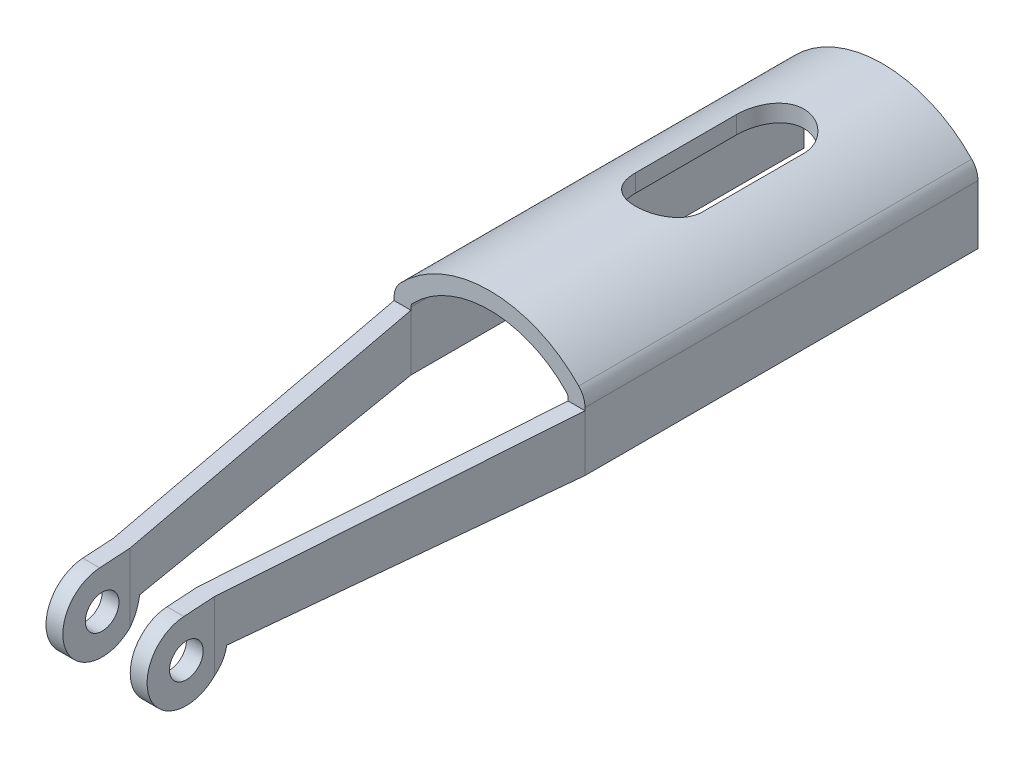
ISO-10303-21;
HEADER;
FILE_DESCRIPTION(('STEP AP214'),'2;1');
FILE_NAME('part.step','',(''),(''),'','','');
FILE_SCHEMA(('AUTOMOTIVE_DESIGN { 1 0 10303 214 1 1 1 1 }'));
ENDSEC;
DATA;
#1=APPLICATION_CONTEXT('core data for automotive mechanical design processes');
#2=APPLICATION_PROTOCOL_DEFINITION('international standard','automotive_design',2000,#1);
#3=PRODUCT_CONTEXT('',#1,'mechanical');
#4=PRODUCT('Part','Part','',(#3));
#5=PRODUCT_RELATED_PRODUCT_CATEGORY('part','',(#4));
#6=PRODUCT_DEFINITION_FORMATION('','',#4);
#7=PRODUCT_DEFINITION_CONTEXT('part definition',#1,'design');
#8=PRODUCT_DEFINITION('design','',#6,#7);
#9=PRODUCT_DEFINITION_SHAPE('','',#8);
#10=(LENGTH_UNIT() NAMED_UNIT(*) SI_UNIT(.MILLI.,.METRE.));
#11=(NAMED_UNIT(*) PLANE_ANGLE_UNIT() SI_UNIT($,.RADIAN.));
#12=(NAMED_UNIT(*) SI_UNIT($,.STERADIAN.) SOLID_ANGLE_UNIT());
#13=UNCERTAINTY_MEASURE_WITH_UNIT(LENGTH_MEASURE(1.E-05),#10,'distance_accuracy_value','');
#14=(GEOMETRIC_REPRESENTATION_CONTEXT(3) GLOBAL_UNCERTAINTY_ASSIGNED_CONTEXT((#13)) GLOBAL_UNIT_ASSIGNED_CONTEXT((#10,
#11,#12)) REPRESENTATION_CONTEXT('',''));
#15=CARTESIAN_POINT('',(0.,0.,0.));
#16=DIRECTION('',(0.,0.,1.));
#17=DIRECTION('',(1.,0.,0.));
#18=AXIS2_PLACEMENT_3D('',#15,#16,#17);
#19=CARTESIAN_POINT('',(-6.5,6.22494979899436,35.));
#20=DIRECTION('',(0.,0.,1.));
#21=DIRECTION('',(1.,0.,0.));
#22=AXIS2_PLACEMENT_3D('',#19,#20,#21);
#23=PLANE('',#22);
#24=DIRECTION('',(0.,-1.,0.));
#25=VECTOR('',#24,1.);
#26=CARTESIAN_POINT('',(-8.5,6.22494979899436,35.));
#27=LINE('',#26,#25);
#28=CARTESIAN_POINT('',(-8.5,6.22494979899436,35.));
#29=VERTEX_POINT('',#28);
#30=CARTESIAN_POINT('',(-8.5,5.98212002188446,35.));
#31=VERTEX_POINT('',#30);
#32=EDGE_CURVE('E408',#29,#31,#27,.T.);
#33=ORIENTED_EDGE('',*,*,#32,.T.);
#34=DIRECTION('',(1.,0.,0.));
#35=VECTOR('',#34,1.);
#36=CARTESIAN_POINT('',(-8.5,5.98212002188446,35.));
#37=LINE('',#36,#35);
#38=CARTESIAN_POINT('',(-7.,5.98212002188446,35.));
#39=VERTEX_POINT('',#38);
#40=EDGE_CURVE('E504',#31,#39,#37,.T.);
#41=ORIENTED_EDGE('',*,*,#40,.T.);
#42=DIRECTION('',(0.,1.,0.));
#43=VECTOR('',#42,1.);
#44=CARTESIAN_POINT('',(-7.,6.22494979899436,35.));
#45=LINE('',#44,#43);
#46=CARTESIAN_POINT('',(-7.,6.22494979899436,35.));
#47=VERTEX_POINT('',#46);
#48=EDGE_CURVE('E412',#39,#47,#45,.T.);
#49=ORIENTED_EDGE('',*,*,#48,.T.);
#50=CARTESIAN_POINT('',(-6.5,6.22494979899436,35.));
#51=DIRECTION('',(0.,0.,-1.));
#52=DIRECTION('',(1.,0.,0.));
#53=AXIS2_PLACEMENT_3D('',#50,#51,#52);
#54=CIRCLE('',#53,0.5);
#55=CARTESIAN_POINT('',(-6.86111111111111,6.57078034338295,35.));
#56=VERTEX_POINT('',#55);
#57=EDGE_CURVE('E416',#47,#56,#54,.T.);
#58=ORIENTED_EDGE('',*,*,#57,.T.);
#59=CARTESIAN_POINT('',(0.,0.,35.));
#60=DIRECTION('',(0.,0.,-1.));
#61=DIRECTION('',(1.,0.,0.));
#62=AXIS2_PLACEMENT_3D('',#59,#60,#61);
#63=CIRCLE('',#62,9.5);
#64=CARTESIAN_POINT('',(6.86111111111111,6.57078034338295,35.));
#65=VERTEX_POINT('',#64);
#66=EDGE_CURVE('E418',#56,#65,#63,.T.);
#67=ORIENTED_EDGE('',*,*,#66,.T.);
#68=CARTESIAN_POINT('',(6.5,6.22494979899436,35.));
#69=DIRECTION('',(0.,0.,-1.));
#70=DIRECTION('',(1.,0.,0.));
#71=AXIS2_PLACEMENT_3D('',#68,#69,#70);
#72=CIRCLE('',#71,0.5);
#73=CARTESIAN_POINT('',(7.,6.22494979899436,35.));
#74=VERTEX_POINT('',#73);
#75=EDGE_CURVE('E420',#65,#74,#72,.T.);
#76=ORIENTED_EDGE('',*,*,#75,.T.);
#77=DIRECTION('',(0.,-1.,0.));
#78=VECTOR('',#77,1.);
#79=CARTESIAN_POINT('',(7.,6.22494979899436,35.));
#80=LINE('',#79,#78);
#81=CARTESIAN_POINT('',(7.,5.98212002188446,35.));
#82=VERTEX_POINT('',#81);
#83=EDGE_CURVE('E422',#74,#82,#80,.T.);
#84=ORIENTED_EDGE('',*,*,#83,.T.);
#85=DIRECTION('',(1.,0.,0.));
#86=VECTOR('',#85,1.);
#87=CARTESIAN_POINT('',(7.,5.98212002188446,35.));
#88=LINE('',#87,#86);
#89=CARTESIAN_POINT('',(8.5,5.98212002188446,35.));
#90=VERTEX_POINT('',#89);
#91=EDGE_CURVE('E352',#82,#90,#88,.T.);
#92=ORIENTED_EDGE('',*,*,#91,.T.);
#93=DIRECTION('',(0.,1.,0.));
#94=VECTOR('',#93,1.);
#95=CARTESIAN_POINT('',(8.5,6.22494979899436,35.));
#96=LINE('',#95,#94);
#97=CARTESIAN_POINT('',(8.5,6.22494979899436,35.));
#98=VERTEX_POINT('',#97);
#99=EDGE_CURVE('E434',#90,#98,#96,.T.);
#100=ORIENTED_EDGE('',*,*,#99,.T.);
#101=CARTESIAN_POINT('',(6.5,6.22494979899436,35.));
#102=DIRECTION('',(0.,0.,1.));
#103=DIRECTION('',(1.,0.,0.));
#104=AXIS2_PLACEMENT_3D('',#101,#102,#103);
#105=CIRCLE('',#104,2.);
#106=CARTESIAN_POINT('',(7.94444444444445,7.60827197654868,35.));
#107=VERTEX_POINT('',#106);
#108=EDGE_CURVE('E440',#98,#107,#105,.T.);
#109=ORIENTED_EDGE('',*,*,#108,.T.);
#110=CARTESIAN_POINT('',(0.,0.,35.));
#111=DIRECTION('',(0.,0.,1.));
#112=DIRECTION('',(1.,0.,0.));
#113=AXIS2_PLACEMENT_3D('',#110,#111,#112);
#114=CIRCLE('',#113,11.);
#115=CARTESIAN_POINT('',(-7.94444444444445,7.60827197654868,35.));
#116=VERTEX_POINT('',#115);
#117=EDGE_CURVE('E443',#107,#116,#114,.T.);
#118=ORIENTED_EDGE('',*,*,#117,.T.);
#119=CARTESIAN_POINT('',(-6.5,6.22494979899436,35.));
#120=DIRECTION('',(0.,0.,1.));
#121=DIRECTION('',(1.,0.,0.));
#122=AXIS2_PLACEMENT_3D('',#119,#120,#121);
#123=CIRCLE('',#122,2.);
#124=EDGE_CURVE('E405',#116,#29,#123,.T.);
#125=ORIENTED_EDGE('',*,*,#124,.T.);
#126=EDGE_LOOP('',(#33,#41,#49,#58,#67,#76,#84,#92,#100,#109,#118,#125));
#127=FACE_BOUND('',#126,.T.);
#128=ADVANCED_FACE('F31',(#127),#23,.T.);
#129=CARTESIAN_POINT('',(-6.5,6.22494979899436,35.));
#130=DIRECTION('',(0.,0.,-1.));
#131=DIRECTION('',(-1.,0.,0.));
#132=AXIS2_PLACEMENT_3D('',#129,#130,#131);
#133=CYLINDRICAL_SURFACE('',#132,2.);
#134=CARTESIAN_POINT('',(-6.5,6.22494979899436,0.));
#135=DIRECTION('',(0.,0.,1.));
#136=DIRECTION('',(1.,0.,0.));
#137=AXIS2_PLACEMENT_3D('',#134,#135,#136);
#138=CIRCLE('',#137,2.);
#139=CARTESIAN_POINT('',(-7.94444444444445,7.60827197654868,0.));
#140=VERTEX_POINT('',#139);
#141=CARTESIAN_POINT('',(-8.5,6.22494979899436,0.));
#142=VERTEX_POINT('',#141);
#143=EDGE_CURVE('E368',#140,#142,#138,.T.);
#144=ORIENTED_EDGE('',*,*,#143,.T.);
#145=DIRECTION('',(0.,0.,-1.));
#146=VECTOR('',#145,1.);
#147=CARTESIAN_POINT('',(-8.5,6.22494979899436,35.));
#148=LINE('',#147,#146);
#149=EDGE_CURVE('E432',#29,#142,#148,.T.);
#150=ORIENTED_EDGE('',*,*,#149,.F.);
#151=ORIENTED_EDGE('',*,*,#124,.F.);
#152=DIRECTION('',(0.,0.,-1.));
#153=VECTOR('',#152,1.);
#154=CARTESIAN_POINT('',(-7.94444444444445,7.60827197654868,35.));
#155=LINE('',#154,#153);
#156=EDGE_CURVE('E445',#116,#140,#155,.T.);
#157=ORIENTED_EDGE('',*,*,#156,.T.);
#158=EDGE_LOOP('',(#144,#150,#151,#157));
#159=FACE_BOUND('',#158,.T.);
#160=ADVANCED_FACE('F33',(#159),#133,.T.);
#161=CARTESIAN_POINT('',(-8.5,6.22494979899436,35.));
#162=DIRECTION('',(1.,0.,0.));
#163=DIRECTION('',(0.,0.,-1.));
#164=AXIS2_PLACEMENT_3D('',#161,#162,#163);
#165=PLANE('',#164);
#166=DIRECTION('',(0.,-1.,0.));
#167=VECTOR('',#166,1.);
#168=CARTESIAN_POINT('',(-8.5,6.22494979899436,0.));
#169=LINE('',#168,#167);
#170=CARTESIAN_POINT('',(-8.5,0.982120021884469,0.));
#171=VERTEX_POINT('',#170);
#172=EDGE_CURVE('E372',#142,#171,#169,.T.);
#173=ORIENTED_EDGE('',*,*,#172,.T.);
#174=DIRECTION('',(0.,0.,-1.));
#175=VECTOR('',#174,1.);
#176=CARTESIAN_POINT('',(-8.5,0.982120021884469,35.));
#177=LINE('',#176,#175);
#178=CARTESIAN_POINT('',(-8.5,0.982120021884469,35.));
#179=VERTEX_POINT('',#178);
#180=EDGE_CURVE('E470',#179,#171,#177,.T.);
#181=ORIENTED_EDGE('',*,*,#180,.F.);
#182=DIRECTION('',(0.,-1.,0.));
#183=VECTOR('',#182,1.);
#184=CARTESIAN_POINT('',(-8.5,5.98212002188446,35.));
#185=LINE('',#184,#183);
#186=EDGE_CURVE('E510',#31,#179,#185,.T.);
#187=ORIENTED_EDGE('',*,*,#186,.F.);
#188=ORIENTED_EDGE('',*,*,#32,.F.);
#189=ORIENTED_EDGE('',*,*,#149,.T.);
#190=EDGE_LOOP('',(#173,#181,#187,#188,#189));
#191=FACE_BOUND('',#190,.T.);
#192=ADVANCED_FACE('F282',(#191),#165,.F.);
#193=CARTESIAN_POINT('',(-7.,0.982120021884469,35.));
#194=DIRECTION('',(0.,1.,0.));
#195=DIRECTION('',(0.,0.,1.));
#196=AXIS2_PLACEMENT_3D('',#193,#194,#195);
#197=PLANE('',#196);
#198=DIRECTION('',(1.,0.,0.));
#199=VECTOR('',#198,1.);
#200=CARTESIAN_POINT('',(-7.,0.982120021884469,0.));
#201=LINE('',#200,#199);
#202=CARTESIAN_POINT('',(-7.,0.982120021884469,0.));
#203=VERTEX_POINT('',#202);
#204=EDGE_CURVE('E385',#171,#203,#201,.T.);
#205=ORIENTED_EDGE('',*,*,#204,.T.);
#206=DIRECTION('',(0.,0.,-1.));
#207=VECTOR('',#206,1.);
#208=CARTESIAN_POINT('',(-7.,0.982120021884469,35.));
#209=LINE('',#208,#207);
#210=CARTESIAN_POINT('',(-7.,0.982120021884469,35.));
#211=VERTEX_POINT('',#210);
#212=EDGE_CURVE('E468',#211,#203,#209,.T.);
#213=ORIENTED_EDGE('',*,*,#212,.F.);
#214=DIRECTION('',(1.,0.,0.));
#215=VECTOR('',#214,1.);
#216=CARTESIAN_POINT('',(-7.,0.982120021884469,35.));
#217=LINE('',#216,#215);
#218=EDGE_CURVE('E410',#179,#211,#217,.T.);
#219=ORIENTED_EDGE('',*,*,#218,.F.);
#220=ORIENTED_EDGE('',*,*,#180,.T.);
#221=EDGE_LOOP('',(#205,#213,#219,#220));
#222=FACE_BOUND('',#221,.T.);
#223=ADVANCED_FACE('F604',(#222),#197,.F.);
#224=CARTESIAN_POINT('',(-7.,6.22494979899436,35.));
#225=DIRECTION('',(-1.,0.,0.));
#226=DIRECTION('',(0.,-1.,0.));
#227=AXIS2_PLACEMENT_3D('',#224,#225,#226);
#228=PLANE('',#227);
#229=DIRECTION('',(0.,1.,0.));
#230=VECTOR('',#229,1.);
#231=CARTESIAN_POINT('',(-7.,6.22494979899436,0.));
#232=LINE('',#231,#230);
#233=CARTESIAN_POINT('',(-7.,6.22494979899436,0.));
#234=VERTEX_POINT('',#233);
#235=EDGE_CURVE('E387',#203,#234,#232,.T.);
#236=ORIENTED_EDGE('',*,*,#235,.T.);
#237=DIRECTION('',(0.,0.,-1.));
#238=VECTOR('',#237,1.);
#239=CARTESIAN_POINT('',(-7.,6.22494979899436,35.));
#240=LINE('',#239,#238);
#241=EDGE_CURVE('E465',#47,#234,#240,.T.);
#242=ORIENTED_EDGE('',*,*,#241,.F.);
#243=ORIENTED_EDGE('',*,*,#48,.F.);
#244=EDGE_CURVE('E413',#211,#39,#45,.T.);
#245=ORIENTED_EDGE('',*,*,#244,.F.);
#246=ORIENTED_EDGE('',*,*,#212,.T.);
#247=EDGE_LOOP('',(#236,#242,#243,#245,#246));
#248=FACE_BOUND('',#247,.T.);
#249=ADVANCED_FACE('F608',(#248),#228,.F.);
#250=CARTESIAN_POINT('',(-6.5,6.22494979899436,35.));
#251=DIRECTION('',(0.,0.,-1.));
#252=DIRECTION('',(-1.,0.,0.));
#253=AXIS2_PLACEMENT_3D('',#250,#251,#252);
#254=CYLINDRICAL_SURFACE('',#253,0.5);
#255=CARTESIAN_POINT('',(-6.5,6.22494979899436,0.));
#256=DIRECTION('',(0.,0.,-1.));
#257=DIRECTION('',(1.,0.,0.));
#258=AXIS2_PLACEMENT_3D('',#255,#256,#257);
#259=CIRCLE('',#258,0.5);
#260=CARTESIAN_POINT('',(-6.86111111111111,6.57078034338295,0.));
#261=VERTEX_POINT('',#260);
#262=EDGE_CURVE('E389',#234,#261,#259,.T.);
#263=ORIENTED_EDGE('',*,*,#262,.T.);
#264=DIRECTION('',(0.,0.,-1.));
#265=VECTOR('',#264,1.);
#266=CARTESIAN_POINT('',(-6.86111111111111,6.57078034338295,35.));
#267=LINE('',#266,#265);
#268=EDGE_CURVE('E462',#56,#261,#267,.T.);
#269=ORIENTED_EDGE('',*,*,#268,.F.);
#270=ORIENTED_EDGE('',*,*,#57,.F.);
#271=ORIENTED_EDGE('',*,*,#241,.T.);
#272=EDGE_LOOP('',(#263,#269,#270,#271));
#273=FACE_BOUND('',#272,.T.);
#274=ADVANCED_FACE('F256',(#273),#254,.F.);
#275=CARTESIAN_POINT('',(0.,0.,35.));
#276=DIRECTION('',(0.,0.,-1.));
#277=DIRECTION('',(-1.,0.,0.));
#278=AXIS2_PLACEMENT_3D('',#275,#276,#277);
#279=CYLINDRICAL_SURFACE('',#278,9.5);
#280=DIRECTION('',(0.,0.,-1.));
#281=VECTOR('',#280,1.);
#282=CARTESIAN_POINT('',(-3.,9.01387818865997,35.));
#283=LINE('',#282,#281);
#284=CARTESIAN_POINT('',(-3.,9.01387818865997,10.));
#285=VERTEX_POINT('',#284);
#286=CARTESIAN_POINT('',(-3.,9.01387818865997,19.0000000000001));
#287=VERTEX_POINT('',#286);
#288=EDGE_CURVE('E266',#285,#287,#283,.F.);
#289=ORIENTED_EDGE('',*,*,#288,.T.);
#290=CARTESIAN_POINT('',(0.,9.49999999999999,16.0000000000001));
#291=CARTESIAN_POINT('',(-0.164167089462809,9.49999935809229,16.0000008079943));
#292=CARTESIAN_POINT('',(-0.328342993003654,9.49570457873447,16.0135197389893));
#293=CARTESIAN_POINT('',(-0.651888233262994,9.47899296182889,16.0670928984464));
#294=CARTESIAN_POINT('',(-0.811256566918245,9.46657444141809,16.1071526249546));
#295=CARTESIAN_POINT('',(-1.12047453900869,9.43497086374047,16.2123179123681));
#296=CARTESIAN_POINT('',(-1.2703386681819,9.4157964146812,16.277384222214));
#297=CARTESIAN_POINT('',(-1.55702915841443,9.37265725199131,16.4305470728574));
#298=CARTESIAN_POINT('',(-1.69385337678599,9.34869175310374,16.5186473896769));
#299=CARTESIAN_POINT('',(-1.954886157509,9.29766753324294,16.7182946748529));
#300=CARTESIAN_POINT('',(-2.07862693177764,9.27054036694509,16.8304356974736));
#301=CARTESIAN_POINT('',(-2.30589485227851,9.21664353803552,17.0737165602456));
#302=CARTESIAN_POINT('',(-2.4094181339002,9.18987394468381,17.2048600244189));
#303=CARTESIAN_POINT('',(-2.59586933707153,9.1389859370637,17.4864975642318));
#304=CARTESIAN_POINT('',(-2.67820924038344,9.11495183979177,17.6373976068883));
#305=CARTESIAN_POINT('',(-2.81614778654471,9.07328724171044,17.9517849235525));
#306=CARTESIAN_POINT('',(-2.87175364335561,9.05565501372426,18.1152687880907));
#307=CARTESIAN_POINT('',(-2.95292728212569,9.02950721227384,18.4448978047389));
#308=CARTESIAN_POINT('',(-2.97936420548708,9.02072856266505,18.6108074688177));
#309=CARTESIAN_POINT('',(-3.00416514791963,9.01250122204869,18.9449217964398));
#310=CARTESIAN_POINT('',(-3.00253681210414,9.01304999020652,19.1131258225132));
#311=CARTESIAN_POINT('',(-2.97193247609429,9.02318352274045,19.4398310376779));
#312=CARTESIAN_POINT('',(-2.94406576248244,9.03240174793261,19.5984494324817));
#313=CARTESIAN_POINT('',(-2.86357596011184,9.05823941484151,19.9086330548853));
#314=CARTESIAN_POINT('',(-2.81095018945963,9.07485965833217,20.0601975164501));
#315=CARTESIAN_POINT('',(-2.68166168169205,9.11390651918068,20.3545945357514));
#316=CARTESIAN_POINT('',(-2.60465367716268,9.13641567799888,20.4972640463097));
#317=CARTESIAN_POINT('',(-2.4290264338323,9.1846668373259,20.7680176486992));
#318=CARTESIAN_POINT('',(-2.33040148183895,9.21040969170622,20.896097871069));
#319=CARTESIAN_POINT('',(-2.10891443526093,9.26369376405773,21.1403027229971));
#320=CARTESIAN_POINT('',(-1.98513792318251,9.29126291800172,21.2555934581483));
#321=CARTESIAN_POINT('',(-1.71966506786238,9.34403785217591,21.4639864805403));
#322=CARTESIAN_POINT('',(-1.57796734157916,9.36924344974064,21.5570870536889));
#323=CARTESIAN_POINT('',(-1.27904248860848,9.41472566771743,21.7190380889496));
#324=CARTESIAN_POINT('',(-1.12169880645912,9.43496068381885,21.7876858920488));
#325=CARTESIAN_POINT('',(-0.796908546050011,9.46792126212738,21.897289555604));
#326=CARTESIAN_POINT('',(-0.629465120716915,9.48064915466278,21.9382540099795));
#327=CARTESIAN_POINT('',(-0.296303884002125,9.49678470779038,21.9898989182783));
#328=CARTESIAN_POINT('',(-0.130777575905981,9.50053950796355,22.0017079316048));
#329=CARTESIAN_POINT('',(0.19991137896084,9.49933471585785,21.9978937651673));
#330=CARTESIAN_POINT('',(0.365074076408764,9.49437642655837,21.982274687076));
#331=CARTESIAN_POINT('',(0.68596921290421,9.47653086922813,21.9249518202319));
#332=CARTESIAN_POINT('',(0.84183470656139,9.46384885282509,21.8839228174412));
#333=CARTESIAN_POINT('',(1.14442314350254,9.43204434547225,21.7777712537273));
#334=CARTESIAN_POINT('',(1.29114494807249,9.41292105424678,21.7126456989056));
#335=CARTESIAN_POINT('',(1.57531276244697,9.36960895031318,21.5583538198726));
#336=CARTESIAN_POINT('',(1.71244019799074,9.34530669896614,21.4686334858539));
#337=CARTESIAN_POINT('',(1.97006979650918,9.29441218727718,21.2683613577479));
#338=CARTESIAN_POINT('',(2.09056734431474,9.26781929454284,21.1578038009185));
#339=CARTESIAN_POINT('',(2.31658675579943,9.21398298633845,20.9136868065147));
#340=CARTESIAN_POINT('',(2.42130400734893,9.186756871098,20.7793768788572));
#341=CARTESIAN_POINT('',(2.60679013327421,9.13585946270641,20.4944999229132));
#342=CARTESIAN_POINT('',(2.68755931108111,9.11218812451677,20.3439331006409));
#343=CARTESIAN_POINT('',(2.8223709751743,9.0713392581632,20.0310761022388));
#344=CARTESIAN_POINT('',(2.87651039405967,9.05413823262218,19.8688309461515));
#345=CARTESIAN_POINT('',(2.95649944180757,9.0283393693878,19.5368703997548));
#346=CARTESIAN_POINT('',(2.98236013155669,9.0197381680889,19.3671579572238));
#347=CARTESIAN_POINT('',(3.00425241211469,9.01246833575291,19.0335061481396));
#348=CARTESIAN_POINT('',(3.00160628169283,9.01335938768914,18.8696620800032));
#349=CARTESIAN_POINT('',(2.96976166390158,9.02390107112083,18.5448766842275));
#350=CARTESIAN_POINT('',(2.94056446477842,9.0335512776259,18.3839352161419));
#351=CARTESIAN_POINT('',(2.85733979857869,9.06021304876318,18.071943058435));
#352=CARTESIAN_POINT('',(2.80369834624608,9.07710994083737,17.9207788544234));
#353=CARTESIAN_POINT('',(2.67341300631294,9.11632984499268,17.6294760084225));
#354=CARTESIAN_POINT('',(2.59676436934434,9.13865397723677,17.4893396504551));
#355=CARTESIAN_POINT('',(2.4190708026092,9.18732235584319,17.218026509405));
#356=CARTESIAN_POINT('',(2.31717569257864,9.21379131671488,17.0874289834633));
#357=CARTESIAN_POINT('',(2.0933684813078,9.26720162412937,16.8447583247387));
#358=CARTESIAN_POINT('',(1.97145098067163,9.29414309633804,16.7326902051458));
#359=CARTESIAN_POINT('',(1.7061326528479,9.34654886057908,16.5264861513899));
#360=CARTESIAN_POINT('',(1.56214764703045,9.37193310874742,16.4330792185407));
#361=CARTESIAN_POINT('',(1.25971894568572,9.41734758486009,16.2719166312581));
#362=CARTESIAN_POINT('',(1.10128066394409,9.4373798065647,16.2041514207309));
#363=CARTESIAN_POINT('',(0.787271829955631,9.468532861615,16.1008024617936));
#364=CARTESIAN_POINT('',(0.632450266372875,9.48022921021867,16.0631122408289));
#365=CARTESIAN_POINT('',(0.318421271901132,9.49596227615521,16.0127132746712));
#366=CARTESIAN_POINT('',(0.159214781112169,9.50000062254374,15.99999921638));
#367=CARTESIAN_POINT('',(0.,9.49999999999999,16.0000000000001));
#368=B_SPLINE_CURVE_WITH_KNOTS('',3,(#290,#291,#292,#293,#294,#295,#296,#297,#298,#299,#300,
#301,#302,#303,#304,#305,#306,#307,#308,#309,#310,#311,#312,#313,#314,#315,#316,#317,#318,#319,
#320,#321,#322,#323,#324,#325,#326,#327,#328,#329,#330,#331,#332,#333,#334,#335,#336,#337,#338,
#339,#340,#341,#342,#343,#344,#345,#346,#347,#348,#349,#350,#351,#352,#353,#354,#355,#356,#357,
#358,#359,#360,#361,#362,#363,#364,#365,#366,#367),.UNSPECIFIED.,.T.,.F.,(4,2,2,2,2,2,2,2,2,2,2,
2,2,2,2,2,2,2,2,2,2,2,2,2,2,2,2,2,2,2,2,2,2,2,2,2,2,2,4),(0.,0.49191594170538,0.98393381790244,
1.47518254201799,1.9665118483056,2.47177433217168,2.97713330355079,3.49529138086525,
4.0133095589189,4.51543663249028,5.01742692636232,5.49910423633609,5.98083373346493,
6.46971527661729,6.95872618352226,7.47049694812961,7.98230723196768,8.49826565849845,
9.01406383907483,9.50955937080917,10.0049808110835,10.487778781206,10.9706367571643,
11.4654198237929,11.9603399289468,12.4753133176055,12.9902801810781,13.5033584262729,
14.0162359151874,14.5054301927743,14.9946007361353,15.4763007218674,15.9581002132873,
16.4590917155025,16.9602185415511,17.4781824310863,17.9959530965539,18.4731312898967,
18.9502079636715),.UNSPECIFIED.);
#369=CARTESIAN_POINT('',(3.,9.01387818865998,19.0000000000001));
#370=VERTEX_POINT('',#369);
#371=EDGE_CURVE('E210',#287,#370,#368,.T.);
#372=ORIENTED_EDGE('',*,*,#371,.T.);
#373=DIRECTION('',(0.,0.,-1.));
#374=VECTOR('',#373,1.);
#375=CARTESIAN_POINT('',(3.,9.01387818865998,35.));
#376=LINE('',#375,#374);
#377=CARTESIAN_POINT('',(3.,9.01387818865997,10.));
#378=VERTEX_POINT('',#377);
#379=EDGE_CURVE('E247',#370,#378,#376,.T.);
#380=ORIENTED_EDGE('',*,*,#379,.T.);
#381=CARTESIAN_POINT('',(0.,9.49999999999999,7.));
#382=CARTESIAN_POINT('',(-0.164167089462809,9.49999935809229,7.0000008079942));
#383=CARTESIAN_POINT('',(-0.328342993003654,9.49570457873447,7.01351973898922));
#384=CARTESIAN_POINT('',(-0.651888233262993,9.47899296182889,7.06709289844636));
#385=CARTESIAN_POINT('',(-0.811256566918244,9.46657444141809,7.10715262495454));
#386=CARTESIAN_POINT('',(-1.12047453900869,9.43497086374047,7.21231791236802));
#387=CARTESIAN_POINT('',(-1.2703386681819,9.4157964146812,7.27738422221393));
#388=CARTESIAN_POINT('',(-1.55702915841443,9.37265725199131,7.43054707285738));
#389=CARTESIAN_POINT('',(-1.69385337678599,9.34869175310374,7.51864738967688));
#390=CARTESIAN_POINT('',(-1.954886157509,9.29766753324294,7.71829467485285));
#391=CARTESIAN_POINT('',(-2.07862693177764,9.27054036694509,7.83043569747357));
#392=CARTESIAN_POINT('',(-2.30589485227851,9.21664353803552,8.07371656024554));
#393=CARTESIAN_POINT('',(-2.4094181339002,9.18987394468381,8.20486002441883));
#394=CARTESIAN_POINT('',(-2.59586933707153,9.1389859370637,8.48649756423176));
#395=CARTESIAN_POINT('',(-2.67820924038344,9.11495183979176,8.63739760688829));
#396=CARTESIAN_POINT('',(-2.81614778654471,9.07328724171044,8.95178492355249));
#397=CARTESIAN_POINT('',(-2.87175364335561,9.05565501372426,9.11526878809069));
#398=CARTESIAN_POINT('',(-2.95292728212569,9.02950721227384,9.44489780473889));
#399=CARTESIAN_POINT('',(-2.97936420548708,9.02072856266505,9.6108074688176));
#400=CARTESIAN_POINT('',(-3.00416514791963,9.01250122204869,9.94492179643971));
#401=CARTESIAN_POINT('',(-3.00253681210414,9.01304999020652,10.1131258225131));
#402=CARTESIAN_POINT('',(-2.97193247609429,9.02318352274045,10.4398310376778));
#403=CARTESIAN_POINT('',(-2.94406576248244,9.03240174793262,10.5984494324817));
#404=CARTESIAN_POINT('',(-2.86357596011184,9.05823941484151,10.9086330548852));
#405=CARTESIAN_POINT('',(-2.81095018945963,9.07485965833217,11.0601975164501));
#406=CARTESIAN_POINT('',(-2.68166168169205,9.11390651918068,11.3545945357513));
#407=CARTESIAN_POINT('',(-2.60465367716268,9.13641567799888,11.4972640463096));
#408=CARTESIAN_POINT('',(-2.4290264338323,9.1846668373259,11.7680176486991));
#409=CARTESIAN_POINT('',(-2.33040148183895,9.21040969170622,11.896097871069));
#410=CARTESIAN_POINT('',(-2.10891443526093,9.26369376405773,12.140302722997));
#411=CARTESIAN_POINT('',(-1.98513792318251,9.29126291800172,12.2555934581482));
#412=CARTESIAN_POINT('',(-1.71966506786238,9.34403785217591,12.4639864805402));
#413=CARTESIAN_POINT('',(-1.57796734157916,9.36924344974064,12.5570870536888));
#414=CARTESIAN_POINT('',(-1.27904248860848,9.41472566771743,12.7190380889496));
#415=CARTESIAN_POINT('',(-1.12169880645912,9.43496068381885,12.7876858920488));
#416=CARTESIAN_POINT('',(-0.796908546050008,9.46792126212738,12.8972895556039));
#417=CARTESIAN_POINT('',(-0.629465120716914,9.48064915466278,12.9382540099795));
#418=CARTESIAN_POINT('',(-0.296303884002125,9.49678470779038,12.9898989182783));
#419=CARTESIAN_POINT('',(-0.13077757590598,9.50053950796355,13.0017079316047));
#420=CARTESIAN_POINT('',(0.19991137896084,9.49933471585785,12.9978937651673));
#421=CARTESIAN_POINT('',(0.365074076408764,9.49437642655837,12.982274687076));
#422=CARTESIAN_POINT('',(0.68596921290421,9.47653086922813,12.9249518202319));
#423=CARTESIAN_POINT('',(0.84183470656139,9.46384885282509,12.8839228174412));
#424=CARTESIAN_POINT('',(1.14442314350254,9.43204434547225,12.7777712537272));
#425=CARTESIAN_POINT('',(1.29114494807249,9.41292105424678,12.7126456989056));
#426=CARTESIAN_POINT('',(1.57531276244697,9.36960895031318,12.5583538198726));
#427=CARTESIAN_POINT('',(1.71244019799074,9.34530669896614,12.4686334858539));
#428=CARTESIAN_POINT('',(1.97006979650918,9.29441218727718,12.2683613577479));
#429=CARTESIAN_POINT('',(2.09056734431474,9.26781929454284,12.1578038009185));
#430=CARTESIAN_POINT('',(2.31658675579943,9.21398298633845,11.9136868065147));
#431=CARTESIAN_POINT('',(2.42130400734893,9.186756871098,11.7793768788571));
#432=CARTESIAN_POINT('',(2.60679013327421,9.1358594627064,11.4944999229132));
#433=CARTESIAN_POINT('',(2.68755931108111,9.11218812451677,11.3439331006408));
#434=CARTESIAN_POINT('',(2.8223709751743,9.0713392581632,11.0310761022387));
#435=CARTESIAN_POINT('',(2.87651039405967,9.05413823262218,10.8688309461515));
#436=CARTESIAN_POINT('',(2.95649944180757,9.0283393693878,10.5368703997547));
#437=CARTESIAN_POINT('',(2.98236013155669,9.0197381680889,10.3671579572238));
#438=CARTESIAN_POINT('',(3.00425241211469,9.01246833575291,10.0335061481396));
#439=CARTESIAN_POINT('',(3.00160628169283,9.01335938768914,9.8696620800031));
#440=CARTESIAN_POINT('',(2.96976166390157,9.02390107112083,9.54487668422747));
#441=CARTESIAN_POINT('',(2.94056446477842,9.0335512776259,9.38393521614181));
#442=CARTESIAN_POINT('',(2.8573397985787,9.06021304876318,9.07194305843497));
#443=CARTESIAN_POINT('',(2.80369834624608,9.07710994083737,8.92077885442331));
#444=CARTESIAN_POINT('',(2.67341300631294,9.11632984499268,8.6294760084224));
#445=CARTESIAN_POINT('',(2.59676436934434,9.13865397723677,8.48933965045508));
#446=CARTESIAN_POINT('',(2.4190708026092,9.1873223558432,8.21802650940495));
#447=CARTESIAN_POINT('',(2.31717569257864,9.21379131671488,8.08742898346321));
#448=CARTESIAN_POINT('',(2.09336848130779,9.26720162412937,7.84475832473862));
#449=CARTESIAN_POINT('',(1.97145098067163,9.29414309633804,7.73269020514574));
#450=CARTESIAN_POINT('',(1.7061326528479,9.34654886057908,7.52648615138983));
#451=CARTESIAN_POINT('',(1.56214764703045,9.37193310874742,7.43307921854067));
#452=CARTESIAN_POINT('',(1.25971894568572,9.41734758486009,7.27191663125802));
#453=CARTESIAN_POINT('',(1.10128066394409,9.4373798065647,7.20415142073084));
#454=CARTESIAN_POINT('',(0.787271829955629,9.468532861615,7.10080246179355));
#455=CARTESIAN_POINT('',(0.632450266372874,9.48022921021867,7.06311224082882));
#456=CARTESIAN_POINT('',(0.318421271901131,9.49596227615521,7.01271327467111));
#457=CARTESIAN_POINT('',(0.159214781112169,9.50000062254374,6.99999921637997));
#458=CARTESIAN_POINT('',(0.,9.49999999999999,7.));
#459=B_SPLINE_CURVE_WITH_KNOTS('',3,(#381,#382,#383,#384,#385,#386,#387,#388,#389,#390,#391,
#392,#393,#394,#395,#396,#397,#398,#399,#400,#401,#402,#403,#404,#405,#406,#407,#408,#409,#410,
#411,#412,#413,#414,#415,#416,#417,#418,#419,#420,#421,#422,#423,#424,#425,#426,#427,#428,#429,
#430,#431,#432,#433,#434,#435,#436,#437,#438,#439,#440,#441,#442,#443,#444,#445,#446,#447,#448,
#449,#450,#451,#452,#453,#454,#455,#456,#457,#458),.UNSPECIFIED.,.T.,.F.,(4,2,2,2,2,2,2,2,2,2,2,
2,2,2,2,2,2,2,2,2,2,2,2,2,2,2,2,2,2,2,2,2,2,2,2,2,2,2,4),(0.,0.49191594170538,0.983933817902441,
1.47518254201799,1.9665118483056,2.47177433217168,2.97713330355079,3.49529138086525,
4.0133095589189,4.51543663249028,5.01742692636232,5.49910423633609,5.98083373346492,
6.46971527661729,6.95872618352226,7.47049694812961,7.98230723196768,8.49826565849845,
9.01406383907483,9.50955937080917,10.0049808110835,10.487778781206,10.9706367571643,
11.4654198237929,11.9603399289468,12.4753133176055,12.9902801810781,13.5033584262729,
14.0162359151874,14.5054301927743,14.9946007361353,15.4763007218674,15.9581002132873,
16.4590917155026,16.9602185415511,17.4781824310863,17.9959530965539,18.4731312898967,
18.9502079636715),.UNSPECIFIED.);
#460=EDGE_CURVE('E261',#378,#285,#459,.T.);
#461=ORIENTED_EDGE('',*,*,#460,.T.);
#462=EDGE_LOOP('',(#289,#372,#380,#461));
#463=FACE_BOUND('',#462,.T.);
#464=CARTESIAN_POINT('',(0.,0.,0.));
#465=DIRECTION('',(0.,0.,-1.));
#466=DIRECTION('',(1.,0.,0.));
#467=AXIS2_PLACEMENT_3D('',#464,#465,#466);
#468=CIRCLE('',#467,9.5);
#469=CARTESIAN_POINT('',(6.86111111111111,6.57078034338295,0.));
#470=VERTEX_POINT('',#469);
#471=EDGE_CURVE('E391',#261,#470,#468,.T.);
#472=ORIENTED_EDGE('',*,*,#471,.T.);
#473=DIRECTION('',(0.,0.,-1.));
#474=VECTOR('',#473,1.);
#475=CARTESIAN_POINT('',(6.86111111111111,6.57078034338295,35.));
#476=LINE('',#475,#474);
#477=EDGE_CURVE('E458',#65,#470,#476,.T.);
#478=ORIENTED_EDGE('',*,*,#477,.F.);
#479=ORIENTED_EDGE('',*,*,#66,.F.);
#480=ORIENTED_EDGE('',*,*,#268,.T.);
#481=EDGE_LOOP('',(#472,#478,#479,#480));
#482=FACE_BOUND('',#481,.T.);
#483=ADVANCED_FACE('F250',(#463,#482),#279,.F.);
#484=CARTESIAN_POINT('',(6.5,6.22494979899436,35.));
#485=DIRECTION('',(0.,0.,-1.));
#486=DIRECTION('',(-1.,0.,0.));
#487=AXIS2_PLACEMENT_3D('',#484,#485,#486);
#488=CYLINDRICAL_SURFACE('',#487,0.5);
#489=CARTESIAN_POINT('',(6.5,6.22494979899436,0.));
#490=DIRECTION('',(0.,0.,-1.));
#491=DIRECTION('',(1.,0.,0.));
#492=AXIS2_PLACEMENT_3D('',#489,#490,#491);
#493=CIRCLE('',#492,0.5);
#494=CARTESIAN_POINT('',(7.,6.22494979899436,0.));
#495=VERTEX_POINT('',#494);
#496=EDGE_CURVE('E393',#470,#495,#493,.T.);
#497=ORIENTED_EDGE('',*,*,#496,.T.);
#498=DIRECTION('',(0.,0.,-1.));
#499=VECTOR('',#498,1.);
#500=CARTESIAN_POINT('',(7.,6.22494979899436,35.));
#501=LINE('',#500,#499);
#502=EDGE_CURVE('E455',#74,#495,#501,.T.);
#503=ORIENTED_EDGE('',*,*,#502,.F.);
#504=ORIENTED_EDGE('',*,*,#75,.F.);
#505=ORIENTED_EDGE('',*,*,#477,.T.);
#506=EDGE_LOOP('',(#497,#503,#504,#505));
#507=FACE_BOUND('',#506,.T.);
#508=ADVANCED_FACE('F255',(#507),#488,.F.);
#509=CARTESIAN_POINT('',(7.,6.22494979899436,35.));
#510=DIRECTION('',(1.,0.,0.));
#511=DIRECTION('',(0.,1.,0.));
#512=AXIS2_PLACEMENT_3D('',#509,#510,#511);
#513=PLANE('',#512);
#514=DIRECTION('',(0.,-1.,0.));
#515=VECTOR('',#514,1.);
#516=CARTESIAN_POINT('',(7.,6.22494979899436,0.));
#517=LINE('',#516,#515);
#518=CARTESIAN_POINT('',(7.,0.982120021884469,0.));
#519=VERTEX_POINT('',#518);
#520=EDGE_CURVE('E395',#495,#519,#517,.T.);
#521=ORIENTED_EDGE('',*,*,#520,.T.);
#522=DIRECTION('',(0.,0.,-1.));
#523=VECTOR('',#522,1.);
#524=CARTESIAN_POINT('',(7.,0.982120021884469,35.));
#525=LINE('',#524,#523);
#526=CARTESIAN_POINT('',(7.,0.982120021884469,35.));
#527=VERTEX_POINT('',#526);
#528=EDGE_CURVE('E459',#527,#519,#525,.T.);
#529=ORIENTED_EDGE('',*,*,#528,.F.);
#530=DIRECTION('',(0.,-1.,0.));
#531=VECTOR('',#530,1.);
#532=CARTESIAN_POINT('',(7.,5.98212002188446,35.));
#533=LINE('',#532,#531);
#534=EDGE_CURVE('E375',#82,#527,#533,.T.);
#535=ORIENTED_EDGE('',*,*,#534,.F.);
#536=ORIENTED_EDGE('',*,*,#83,.F.);
#537=ORIENTED_EDGE('',*,*,#502,.T.);
#538=EDGE_LOOP('',(#521,#529,#535,#536,#537));
#539=FACE_BOUND('',#538,.T.);
#540=ADVANCED_FACE('F624',(#539),#513,.F.);
#541=CARTESIAN_POINT('',(7.,0.982120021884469,35.));
#542=DIRECTION('',(0.,1.,0.));
#543=DIRECTION('',(-1.,0.,0.));
#544=AXIS2_PLACEMENT_3D('',#541,#542,#543);
#545=PLANE('',#544);
#546=DIRECTION('',(1.,0.,0.));
#547=VECTOR('',#546,1.);
#548=CARTESIAN_POINT('',(7.,0.982120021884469,0.));
#549=LINE('',#548,#547);
#550=CARTESIAN_POINT('',(8.5,0.982120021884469,0.));
#551=VERTEX_POINT('',#550);
#552=EDGE_CURVE('E397',#519,#551,#549,.T.);
#553=ORIENTED_EDGE('',*,*,#552,.T.);
#554=DIRECTION('',(0.,0.,-1.));
#555=VECTOR('',#554,1.);
#556=CARTESIAN_POINT('',(8.5,0.982120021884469,35.));
#557=LINE('',#556,#555);
#558=CARTESIAN_POINT('',(8.5,0.982120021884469,35.));
#559=VERTEX_POINT('',#558);
#560=EDGE_CURVE('E454',#559,#551,#557,.T.);
#561=ORIENTED_EDGE('',*,*,#560,.F.);
#562=DIRECTION('',(1.,0.,0.));
#563=VECTOR('',#562,1.);
#564=CARTESIAN_POINT('',(7.,0.982120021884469,35.));
#565=LINE('',#564,#563);
#566=EDGE_CURVE('E431',#527,#559,#565,.T.);
#567=ORIENTED_EDGE('',*,*,#566,.F.);
#568=ORIENTED_EDGE('',*,*,#528,.T.);
#569=EDGE_LOOP('',(#553,#561,#567,#568));
#570=FACE_BOUND('',#569,.T.);
#571=ADVANCED_FACE('F634',(#570),#545,.F.);
#572=CARTESIAN_POINT('',(8.5,6.22494979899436,35.));
#573=DIRECTION('',(-1.,0.,0.));
#574=DIRECTION('',(0.,0.,1.));
#575=AXIS2_PLACEMENT_3D('',#572,#573,#574);
#576=PLANE('',#575);
#577=DIRECTION('',(0.,1.,0.));
#578=VECTOR('',#577,1.);
#579=CARTESIAN_POINT('',(8.5,6.22494979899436,0.));
#580=LINE('',#579,#578);
#581=CARTESIAN_POINT('',(8.5,6.22494979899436,0.));
#582=VERTEX_POINT('',#581);
#583=EDGE_CURVE('E399',#551,#582,#580,.T.);
#584=ORIENTED_EDGE('',*,*,#583,.T.);
#585=DIRECTION('',(0.,0.,-1.));
#586=VECTOR('',#585,1.);
#587=CARTESIAN_POINT('',(8.5,6.22494979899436,35.));
#588=LINE('',#587,#586);
#589=EDGE_CURVE('E451',#98,#582,#588,.T.);
#590=ORIENTED_EDGE('',*,*,#589,.F.);
#591=ORIENTED_EDGE('',*,*,#99,.F.);
#592=EDGE_CURVE('E436',#559,#90,#96,.T.);
#593=ORIENTED_EDGE('',*,*,#592,.F.);
#594=ORIENTED_EDGE('',*,*,#560,.T.);
#595=EDGE_LOOP('',(#584,#590,#591,#593,#594));
#596=FACE_BOUND('',#595,.T.);
#597=ADVANCED_FACE('F590',(#596),#576,.F.);
#598=CARTESIAN_POINT('',(6.5,6.22494979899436,35.));
#599=DIRECTION('',(0.,0.,-1.));
#600=DIRECTION('',(-1.,0.,0.));
#601=AXIS2_PLACEMENT_3D('',#598,#599,#600);
#602=CYLINDRICAL_SURFACE('',#601,2.);
#603=CARTESIAN_POINT('',(6.5,6.22494979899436,0.));
#604=DIRECTION('',(0.,0.,1.));
#605=DIRECTION('',(1.,0.,0.));
#606=AXIS2_PLACEMENT_3D('',#603,#604,#605);
#607=CIRCLE('',#606,2.);
#608=CARTESIAN_POINT('',(7.94444444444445,7.60827197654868,0.));
#609=VERTEX_POINT('',#608);
#610=EDGE_CURVE('E401',#582,#609,#607,.T.);
#611=ORIENTED_EDGE('',*,*,#610,.T.);
#612=DIRECTION('',(0.,0.,-1.));
#613=VECTOR('',#612,1.);
#614=CARTESIAN_POINT('',(7.94444444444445,7.60827197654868,35.));
#615=LINE('',#614,#613);
#616=EDGE_CURVE('E448',#107,#609,#615,.T.);
#617=ORIENTED_EDGE('',*,*,#616,.F.);
#618=ORIENTED_EDGE('',*,*,#108,.F.);
#619=ORIENTED_EDGE('',*,*,#589,.T.);
#620=EDGE_LOOP('',(#611,#617,#618,#619));
#621=FACE_BOUND('',#620,.T.);
#622=ADVANCED_FACE('F596',(#621),#602,.T.);
#623=CARTESIAN_POINT('',(0.,0.,35.));
#624=DIRECTION('',(0.,0.,-1.));
#625=DIRECTION('',(-1.,0.,0.));
#626=AXIS2_PLACEMENT_3D('',#623,#624,#625);
#627=CYLINDRICAL_SURFACE('',#626,11.);
#628=DIRECTION('',(0.,0.,-1.));
#629=VECTOR('',#628,1.);
#630=CARTESIAN_POINT('',(3.,10.5830052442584,35.));
#631=LINE('',#630,#629);
#632=CARTESIAN_POINT('',(3.,10.5830052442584,10.));
#633=VERTEX_POINT('',#632);
#634=CARTESIAN_POINT('',(3.,10.5830052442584,19.0000000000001));
#635=VERTEX_POINT('',#634);
#636=EDGE_CURVE('E11',#633,#635,#631,.F.);
#637=ORIENTED_EDGE('',*,*,#636,.T.);
#638=CARTESIAN_POINT('',(0.,11.,16.0000000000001));
#639=CARTESIAN_POINT('',(0.165241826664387,10.9999976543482,16.0000036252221));
#640=CARTESIAN_POINT('',(0.330521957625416,10.9962401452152,16.0136981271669));
#641=CARTESIAN_POINT('',(0.656311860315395,10.981615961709,16.0680116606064));
#642=CARTESIAN_POINT('',(0.81681945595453,10.97074609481,16.1086427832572));
#643=CARTESIAN_POINT('',(1.12831525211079,10.9430954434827,16.2154034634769));
#644=CARTESIAN_POINT('',(1.27931573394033,10.9263224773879,16.2814993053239));
#645=CARTESIAN_POINT('',(1.56808899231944,10.888633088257,16.4371858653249));
#646=CARTESIAN_POINT('',(1.70586072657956,10.8677163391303,16.5267784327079));
#647=CARTESIAN_POINT('',(1.96759389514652,10.8234279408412,16.7291996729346));
#648=CARTESIAN_POINT('',(2.09119025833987,10.8000128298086,16.8424908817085));
#649=CARTESIAN_POINT('',(2.31788587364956,10.7536422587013,17.0881052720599));
#650=CARTESIAN_POINT('',(2.42098235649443,10.7306868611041,17.2204310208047));
#651=CARTESIAN_POINT('',(2.60555589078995,10.6873876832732,17.503302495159));
#652=CARTESIAN_POINT('',(2.68660853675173,10.6670986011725,17.6541342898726));
#653=CARTESIAN_POINT('',(2.82205832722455,10.6320701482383,17.9679276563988));
#654=CARTESIAN_POINT('',(2.87646063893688,10.6173297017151,18.130886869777));
#655=CARTESIAN_POINT('',(2.95578912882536,10.5955169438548,18.460255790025));
#656=CARTESIAN_POINT('',(2.98137921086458,10.5882722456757,18.6264938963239));
#657=CARTESIAN_POINT('',(3.00442728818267,10.5817565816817,18.9610493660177));
#658=CARTESIAN_POINT('',(3.00189080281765,10.5824840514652,19.1293663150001));
#659=CARTESIAN_POINT('',(2.96928383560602,10.5916764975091,19.4580831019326));
#660=CARTESIAN_POINT('',(2.94002147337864,10.5999143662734,19.6185704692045));
#661=CARTESIAN_POINT('',(2.85608967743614,10.6228351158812,19.9322665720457));
#662=CARTESIAN_POINT('',(2.80141813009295,10.6375185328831,20.0854747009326));
#663=CARTESIAN_POINT('',(2.66757259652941,10.6718723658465,20.382347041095));
#664=CARTESIAN_POINT('',(2.58811903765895,10.6915991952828,20.5258784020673));
#665=CARTESIAN_POINT('',(2.40715976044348,10.7337873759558,20.7978528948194));
#666=CARTESIAN_POINT('',(2.30564952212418,10.756249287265,20.9262929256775));
#667=CARTESIAN_POINT('',(2.07934693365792,10.8023178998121,21.1690503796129));
#668=CARTESIAN_POINT('',(1.9538772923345,10.8259374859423,21.2827348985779));
#669=CARTESIAN_POINT('',(1.68536402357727,10.8709729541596,21.4875819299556));
#670=CARTESIAN_POINT('',(1.54231963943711,10.8923887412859,21.5787434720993));
#671=CARTESIAN_POINT('',(1.24170790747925,10.9307455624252,21.7362533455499));
#672=CARTESIAN_POINT('',(1.08407527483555,10.9476650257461,21.8024826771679));
#673=CARTESIAN_POINT('',(0.75934537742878,10.9749671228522,21.9073159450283));
#674=CARTESIAN_POINT('',(0.592250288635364,10.9853512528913,21.9459262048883));
#675=CARTESIAN_POINT('',(0.258736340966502,10.9981845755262,21.993421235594));
#676=CARTESIAN_POINT('',(0.0924485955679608,11.0008632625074,22.0031659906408));
#677=CARTESIAN_POINT('',(-0.239386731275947,10.9986460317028,21.9950345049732));
#678=CARTESIAN_POINT('',(-0.40493439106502,10.9937509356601,21.9771612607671));
#679=CARTESIAN_POINT('',(-0.727490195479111,10.977084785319,21.9150049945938));
#680=CARTESIAN_POINT('',(-0.884598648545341,10.965439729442,21.8712056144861));
#681=CARTESIAN_POINT('',(-1.18921973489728,10.9365984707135,21.759005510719));
#682=CARTESIAN_POINT('',(-1.33673130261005,10.9194016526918,21.6906020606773));
#683=CARTESIAN_POINT('',(-1.62128232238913,10.8808314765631,21.5295671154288));
#684=CARTESIAN_POINT('',(-1.75804920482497,10.8593805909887,21.4364730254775));
#685=CARTESIAN_POINT('',(-2.01432044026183,10.8147797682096,21.229277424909));
#686=CARTESIAN_POINT('',(-2.133821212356,10.7916294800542,21.115171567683));
#687=CARTESIAN_POINT('',(-2.35582120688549,10.7453880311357,20.8651719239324));
#688=CARTESIAN_POINT('',(-2.45771255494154,10.7223188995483,20.7287332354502));
#689=CARTESIAN_POINT('',(-2.63717164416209,10.6796005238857,20.4402027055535));
#690=CARTESIAN_POINT('',(-2.71474035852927,10.6599511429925,20.2881114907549));
#691=CARTESIAN_POINT('',(-2.84277116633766,10.6265249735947,19.9733187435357));
#692=CARTESIAN_POINT('',(-2.8933870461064,10.6127149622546,19.8106834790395));
#693=CARTESIAN_POINT('',(-2.9664183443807,10.5925362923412,19.4787663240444));
#694=CARTESIAN_POINT('',(-2.98884137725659,10.586165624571,19.3094862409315));
#695=CARTESIAN_POINT('',(-3.00439791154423,10.5817601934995,18.9753231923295));
#696=CARTESIAN_POINT('',(-2.99851066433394,10.5834467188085,18.8104888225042));
#697=CARTESIAN_POINT('',(-2.95989675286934,10.5943100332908,18.4842587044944));
#698=CARTESIAN_POINT('',(-2.92717084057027,10.6034866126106,18.3228628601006));
#699=CARTESIAN_POINT('',(-2.83638816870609,10.6281263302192,18.0093873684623));
#700=CARTESIAN_POINT('',(-2.77854790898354,10.6435356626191,17.8572404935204));
#701=CARTESIAN_POINT('',(-2.63934609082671,10.6789037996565,17.5646934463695));
#702=CARTESIAN_POINT('',(-2.55798069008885,10.6988633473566,17.4242951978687));
#703=CARTESIAN_POINT('',(-2.37110861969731,10.7418475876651,17.1545788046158));
#704=CARTESIAN_POINT('',(-2.26493803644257,10.7649475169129,17.0257325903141));
#705=CARTESIAN_POINT('',(-2.0327202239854,10.8111998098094,16.7873671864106));
#706=CARTESIAN_POINT('',(-1.90666811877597,10.834352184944,16.6778527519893));
#707=CARTESIAN_POINT('',(-1.63481545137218,10.8787291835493,16.4788107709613));
#708=CARTESIAN_POINT('',(-1.48863173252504,10.8998981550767,16.3897930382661));
#709=CARTESIAN_POINT('',(-1.18279979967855,10.9373052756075,16.2377351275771));
#710=CARTESIAN_POINT('',(-1.02315990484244,10.9535464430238,16.1746790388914));
#711=CARTESIAN_POINT('',(-0.720200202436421,10.9772838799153,16.0841209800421));
#712=CARTESIAN_POINT('',(-0.578129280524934,10.9857389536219,16.0526508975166));
#713=CARTESIAN_POINT('',(-0.290715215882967,10.9970977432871,16.0105899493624));
#714=CARTESIAN_POINT('',(-0.145372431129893,11.0000020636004,15.9999968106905));
#715=CARTESIAN_POINT('',(0.,11.,16.0000000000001));
#716=B_SPLINE_CURVE_WITH_KNOTS('',3,(#638,#639,#640,#641,#642,#643,#644,#645,#646,#647,#648,
#649,#650,#651,#652,#653,#654,#655,#656,#657,#658,#659,#660,#661,#662,#663,#664,#665,#666,#667,
#668,#669,#670,#671,#672,#673,#674,#675,#676,#677,#678,#679,#680,#681,#682,#683,#684,#685,#686,
#687,#688,#689,#690,#691,#692,#693,#694,#695,#696,#697,#698,#699,#700,#701,#702,#703,#704,#705,
#706,#707,#708,#709,#710,#711,#712,#713,#714,#715),.UNSPECIFIED.,.T.,.F.,(4,2,2,2,2,2,2,2,2,2,2,
2,2,2,2,2,2,2,2,2,2,2,2,2,2,2,2,2,2,2,2,2,2,2,2,2,2,2,4),(0.,0.495192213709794,0.9906068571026,
1.48536780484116,1.98016770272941,2.48571756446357,2.99133567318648,3.50609187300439,
4.02074822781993,4.52328609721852,5.02572535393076,5.51345773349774,6.00123069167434,
6.49471853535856,6.98830760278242,7.4987705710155,8.00925552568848,8.52214699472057,
9.03492099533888,9.53225622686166,10.029537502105,10.5178222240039,11.0061610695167,
11.5043893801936,12.0027208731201,12.5158014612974,13.0288615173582,13.5389619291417,
14.0489245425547,14.5413770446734,15.0338157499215,15.5220911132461,16.0104462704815,
16.5137802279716,17.0172378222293,17.532117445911,18.0466810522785,18.4823766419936,
18.9180247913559),.UNSPECIFIED.);
#717=CARTESIAN_POINT('',(-3.,10.5830052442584,19.0000000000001));
#718=VERTEX_POINT('',#717);
#719=EDGE_CURVE('E204',#635,#718,#716,.T.);
#720=ORIENTED_EDGE('',*,*,#719,.T.);
#721=DIRECTION('',(0.,0.,-1.));
#722=VECTOR('',#721,1.);
#723=CARTESIAN_POINT('',(-3.,10.5830052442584,35.));
#724=LINE('',#723,#722);
#725=CARTESIAN_POINT('',(-3.00000000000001,10.5830052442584,9.99999999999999));
#726=VERTEX_POINT('',#725);
#727=EDGE_CURVE('E39',#718,#726,#724,.T.);
#728=ORIENTED_EDGE('',*,*,#727,.T.);
#729=CARTESIAN_POINT('',(0.,11.,7.));
#730=CARTESIAN_POINT('',(0.165241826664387,10.9999976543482,7.00000362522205));
#731=CARTESIAN_POINT('',(0.330521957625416,10.9962401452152,7.01369812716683));
#732=CARTESIAN_POINT('',(0.656311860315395,10.981615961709,7.06801166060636));
#733=CARTESIAN_POINT('',(0.81681945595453,10.97074609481,7.1086427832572));
#734=CARTESIAN_POINT('',(1.12831525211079,10.9430954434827,7.21540346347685));
#735=CARTESIAN_POINT('',(1.27931573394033,10.9263224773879,7.28149930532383));
#736=CARTESIAN_POINT('',(1.56808899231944,10.888633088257,7.43718586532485));
#737=CARTESIAN_POINT('',(1.70586072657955,10.8677163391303,7.52677843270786));
#738=CARTESIAN_POINT('',(1.96759389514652,10.8234279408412,7.72919967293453));
#739=CARTESIAN_POINT('',(2.09119025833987,10.8000128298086,7.84249088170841));
#740=CARTESIAN_POINT('',(2.31788587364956,10.7536422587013,8.08810527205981));
#741=CARTESIAN_POINT('',(2.42098235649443,10.7306868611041,8.22043102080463));
#742=CARTESIAN_POINT('',(2.60555589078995,10.6873876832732,8.50330249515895));
#743=CARTESIAN_POINT('',(2.68660853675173,10.6670986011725,8.65413428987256));
#744=CARTESIAN_POINT('',(2.82205832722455,10.6320701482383,8.96792765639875));
#745=CARTESIAN_POINT('',(2.87646063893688,10.6173297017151,9.13088686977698));
#746=CARTESIAN_POINT('',(2.95578912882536,10.5955169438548,9.46025579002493));
#747=CARTESIAN_POINT('',(2.98137921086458,10.5882722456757,9.62649389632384));
#748=CARTESIAN_POINT('',(3.00442728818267,10.5817565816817,9.96104936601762));
#749=CARTESIAN_POINT('',(3.00189080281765,10.5824840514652,10.129366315));
#750=CARTESIAN_POINT('',(2.96928383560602,10.5916764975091,10.4580831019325));
#751=CARTESIAN_POINT('',(2.94002147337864,10.5999143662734,10.6185704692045));
#752=CARTESIAN_POINT('',(2.85608967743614,10.6228351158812,10.9322665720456));
#753=CARTESIAN_POINT('',(2.80141813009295,10.6375185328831,11.0854747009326));
#754=CARTESIAN_POINT('',(2.66757259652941,10.6718723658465,11.3823470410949));
#755=CARTESIAN_POINT('',(2.58811903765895,10.6915991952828,11.5258784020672));
#756=CARTESIAN_POINT('',(2.40715976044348,10.7337873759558,11.7978528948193));
#757=CARTESIAN_POINT('',(2.30564952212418,10.756249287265,11.9262929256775));
#758=CARTESIAN_POINT('',(2.07934693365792,10.8023178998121,12.1690503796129));
#759=CARTESIAN_POINT('',(1.9538772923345,10.8259374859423,12.2827348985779));
#760=CARTESIAN_POINT('',(1.68536402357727,10.8709729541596,12.4875819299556));
#761=CARTESIAN_POINT('',(1.54231963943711,10.8923887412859,12.5787434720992));
#762=CARTESIAN_POINT('',(1.24170790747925,10.9307455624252,12.7362533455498));
#763=CARTESIAN_POINT('',(1.08407527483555,10.9476650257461,12.8024826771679));
#764=CARTESIAN_POINT('',(0.759345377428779,10.9749671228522,12.9073159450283));
#765=CARTESIAN_POINT('',(0.592250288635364,10.9853512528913,12.9459262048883));
#766=CARTESIAN_POINT('',(0.258736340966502,10.9981845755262,12.9934212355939));
#767=CARTESIAN_POINT('',(0.0924485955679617,11.0008632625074,13.0031659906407));
#768=CARTESIAN_POINT('',(-0.239386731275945,10.9986460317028,12.9950345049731));
#769=CARTESIAN_POINT('',(-0.404934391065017,10.9937509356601,12.977161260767));
#770=CARTESIAN_POINT('',(-0.727490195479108,10.977084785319,12.9150049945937));
#771=CARTESIAN_POINT('',(-0.884598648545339,10.965439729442,12.871205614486));
#772=CARTESIAN_POINT('',(-1.18921973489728,10.9365984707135,12.759005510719));
#773=CARTESIAN_POINT('',(-1.33673130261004,10.9194016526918,12.6906020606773));
#774=CARTESIAN_POINT('',(-1.62128232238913,10.8808314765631,12.5295671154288));
#775=CARTESIAN_POINT('',(-1.75804920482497,10.8593805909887,12.4364730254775));
#776=CARTESIAN_POINT('',(-2.01432044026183,10.8147797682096,12.229277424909));
#777=CARTESIAN_POINT('',(-2.133821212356,10.7916294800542,12.1151715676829));
#778=CARTESIAN_POINT('',(-2.35582120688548,10.7453880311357,11.8651719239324));
#779=CARTESIAN_POINT('',(-2.45771255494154,10.7223188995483,11.7287332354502));
#780=CARTESIAN_POINT('',(-2.63717164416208,10.6796005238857,11.4402027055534));
#781=CARTESIAN_POINT('',(-2.71474035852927,10.6599511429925,11.2881114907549));
#782=CARTESIAN_POINT('',(-2.84277116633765,10.6265249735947,10.9733187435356));
#783=CARTESIAN_POINT('',(-2.8933870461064,10.6127149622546,10.8106834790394));
#784=CARTESIAN_POINT('',(-2.9664183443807,10.5925362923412,10.4787663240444));
#785=CARTESIAN_POINT('',(-2.98884137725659,10.586165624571,10.3094862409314));
#786=CARTESIAN_POINT('',(-3.00439791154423,10.5817601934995,9.97532319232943));
#787=CARTESIAN_POINT('',(-2.99851066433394,10.5834467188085,9.81048882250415));
#788=CARTESIAN_POINT('',(-2.95989675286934,10.5943100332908,9.48425870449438));
#789=CARTESIAN_POINT('',(-2.92717084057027,10.6034866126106,9.32286286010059));
#790=CARTESIAN_POINT('',(-2.83638816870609,10.6281263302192,9.00938736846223));
#791=CARTESIAN_POINT('',(-2.77854790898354,10.6435356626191,8.85724049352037));
#792=CARTESIAN_POINT('',(-2.63934609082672,10.6789037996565,8.56469344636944));
#793=CARTESIAN_POINT('',(-2.55798069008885,10.6988633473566,8.42429519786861));
#794=CARTESIAN_POINT('',(-2.37110861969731,10.7418475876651,8.1545788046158));
#795=CARTESIAN_POINT('',(-2.26493803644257,10.7649475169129,8.02573259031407));
#796=CARTESIAN_POINT('',(-2.0327202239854,10.8111998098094,7.78736718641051));
#797=CARTESIAN_POINT('',(-1.90666811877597,10.834352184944,7.67785275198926));
#798=CARTESIAN_POINT('',(-1.63481545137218,10.8787291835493,7.47881077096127));
#799=CARTESIAN_POINT('',(-1.48863173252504,10.8998981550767,7.38979303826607));
#800=CARTESIAN_POINT('',(-1.18279979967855,10.9373052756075,7.23773512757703));
#801=CARTESIAN_POINT('',(-1.02315990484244,10.9535464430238,7.17467903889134));
#802=CARTESIAN_POINT('',(-0.720200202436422,10.9772838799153,7.08412098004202));
#803=CARTESIAN_POINT('',(-0.578129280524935,10.9857389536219,7.0526508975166));
#804=CARTESIAN_POINT('',(-0.290715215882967,10.9970977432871,7.01058994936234));
#805=CARTESIAN_POINT('',(-0.145372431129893,11.0000020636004,6.9999968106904));
#806=CARTESIAN_POINT('',(0.,11.,7.));
#807=B_SPLINE_CURVE_WITH_KNOTS('',3,(#729,#730,#731,#732,#733,#734,#735,#736,#737,#738,#739,
#740,#741,#742,#743,#744,#745,#746,#747,#748,#749,#750,#751,#752,#753,#754,#755,#756,#757,#758,
#759,#760,#761,#762,#763,#764,#765,#766,#767,#768,#769,#770,#771,#772,#773,#774,#775,#776,#777,
#778,#779,#780,#781,#782,#783,#784,#785,#786,#787,#788,#789,#790,#791,#792,#793,#794,#795,#796,
#797,#798,#799,#800,#801,#802,#803,#804,#805,#806),.UNSPECIFIED.,.T.,.F.,(4,2,2,2,2,2,2,2,2,2,2,
2,2,2,2,2,2,2,2,2,2,2,2,2,2,2,2,2,2,2,2,2,2,2,2,2,2,2,4),(0.,0.495192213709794,0.9906068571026,
1.48536780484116,1.98016770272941,2.48571756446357,2.99133567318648,3.50609187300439,
4.02074822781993,4.52328609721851,5.02572535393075,5.51345773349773,6.00123069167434,
6.49471853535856,6.98830760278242,7.4987705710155,8.00925552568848,8.52214699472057,
9.03492099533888,9.53225622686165,10.029537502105,10.5178222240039,11.0061610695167,
11.5043893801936,12.0027208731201,12.5158014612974,13.0288615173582,13.5389619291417,
14.0489245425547,14.5413770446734,15.0338157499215,15.5220911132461,16.0104462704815,
16.5137802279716,17.0172378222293,17.5321174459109,18.0466810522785,18.4823766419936,
18.9180247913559),.UNSPECIFIED.);
#808=EDGE_CURVE('E216',#726,#633,#807,.T.);
#809=ORIENTED_EDGE('',*,*,#808,.T.);
#810=EDGE_LOOP('',(#637,#720,#728,#809));
#811=FACE_BOUND('',#810,.T.);
#812=CARTESIAN_POINT('',(0.,0.,0.));
#813=DIRECTION('',(0.,0.,1.));
#814=DIRECTION('',(1.,0.,0.));
#815=AXIS2_PLACEMENT_3D('',#812,#813,#814);
#816=CIRCLE('',#815,11.);
#817=EDGE_CURVE('E403',#609,#140,#816,.T.);
#818=ORIENTED_EDGE('',*,*,#817,.T.);
#819=ORIENTED_EDGE('',*,*,#156,.F.);
#820=ORIENTED_EDGE('',*,*,#117,.F.);
#821=ORIENTED_EDGE('',*,*,#616,.T.);
#822=EDGE_LOOP('',(#818,#819,#820,#821));
#823=FACE_BOUND('',#822,.T.);
#824=ADVANCED_FACE('F213',(#811,#823),#627,.T.);
#825=CARTESIAN_POINT('',(-6.5,6.22494979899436,0.));
#826=DIRECTION('',(0.,0.,1.));
#827=DIRECTION('',(1.,0.,0.));
#828=AXIS2_PLACEMENT_3D('',#825,#826,#827);
#829=PLANE('',#828);
#830=ORIENTED_EDGE('',*,*,#143,.F.);
#831=ORIENTED_EDGE('',*,*,#817,.F.);
#832=ORIENTED_EDGE('',*,*,#610,.F.);
#833=ORIENTED_EDGE('',*,*,#583,.F.);
#834=ORIENTED_EDGE('',*,*,#552,.F.);
#835=ORIENTED_EDGE('',*,*,#520,.F.);
#836=ORIENTED_EDGE('',*,*,#496,.F.);
#837=ORIENTED_EDGE('',*,*,#471,.F.);
#838=ORIENTED_EDGE('',*,*,#262,.F.);
#839=ORIENTED_EDGE('',*,*,#235,.F.);
#840=ORIENTED_EDGE('',*,*,#204,.F.);
#841=ORIENTED_EDGE('',*,*,#172,.F.);
#842=EDGE_LOOP('',(#830,#831,#832,#833,#834,#835,#836,#837,#838,#839,#840,#841));
#843=FACE_BOUND('',#842,.T.);
#844=ADVANCED_FACE('F286',(#843),#829,.F.);
#845=CARTESIAN_POINT('',(7.,5.98212002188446,35.));
#846=DIRECTION('',(-0.990621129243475,0.,-0.136637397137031));
#847=DIRECTION('',(-0.136637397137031,0.,0.990621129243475));
#848=AXIS2_PLACEMENT_3D('',#845,#846,#847);
#849=PLANE('',#848);
#850=DIRECTION('',(-0.136369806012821,-0.0625537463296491,0.98868109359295));
#851=VECTOR('',#850,1.);
#852=CARTESIAN_POINT('',(7.,5.98212002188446,35.));
#853=LINE('',#852,#851);
#854=CARTESIAN_POINT('',(2.99999999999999,4.14729314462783,64.));
#855=VERTEX_POINT('',#854);
#856=EDGE_CURVE('E346',#82,#855,#853,.T.);
#857=ORIENTED_EDGE('',*,*,#856,.F.);
#858=ORIENTED_EDGE('',*,*,#534,.T.);
#859=DIRECTION('',(0.136552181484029,0.0353119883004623,-0.990003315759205));
#860=VECTOR('',#859,1.);
#861=CARTESIAN_POINT('',(7.02410964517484,0.988354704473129,34.8252050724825));
#862=LINE('',#861,#860);
#863=CARTESIAN_POINT('',(3.13297953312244,-0.0178799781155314,63.0358983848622));
#864=VERTEX_POINT('',#863);
#865=EDGE_CURVE('E502',#864,#527,#862,.T.);
#866=ORIENTED_EDGE('',*,*,#865,.F.);
#867=CARTESIAN_POINT('',(2.6551724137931,0.482120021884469,66.5));
#868=DIRECTION('',(-0.990621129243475,0.,-0.136637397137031));
#869=DIRECTION('',(0.136637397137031,0.,-0.990621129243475));
#870=AXIS2_PLACEMENT_3D('',#867,#868,#869);
#871=ELLIPSE('',#870,3.53313683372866,3.5);
#872=CARTESIAN_POINT('',(2.99999999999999,-1.9673697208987,64.));
#873=VERTEX_POINT('',#872);
#874=EDGE_CURVE('E367',#873,#864,#871,.F.);
#875=ORIENTED_EDGE('',*,*,#874,.F.);
#876=DIRECTION('',(0.,-1.,0.));
#877=VECTOR('',#876,1.);
#878=CARTESIAN_POINT('',(2.99999999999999,5.98212002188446,64.));
#879=LINE('',#878,#877);
#880=EDGE_CURVE('E361',#855,#873,#879,.T.);
#881=ORIENTED_EDGE('',*,*,#880,.F.);
#882=EDGE_LOOP('',(#857,#858,#866,#875,#881));
#883=FACE_BOUND('',#882,.T.);
#884=ADVANCED_FACE('F289',(#883),#849,.T.);
#885=CARTESIAN_POINT('',(2.99999999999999,5.98212002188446,70.));
#886=DIRECTION('',(-1.,0.,0.));
#887=DIRECTION('',(0.,0.,1.));
#888=AXIS2_PLACEMENT_3D('',#885,#886,#887);
#889=PLANE('',#888);
#890=CARTESIAN_POINT('',(2.99999999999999,0.482120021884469,66.5));
#891=DIRECTION('',(-1.,0.,0.));
#892=DIRECTION('',(0.,0.,1.));
#893=AXIS2_PLACEMENT_3D('',#890,#891,#892);
#894=CIRCLE('',#893,1.5);
#895=CARTESIAN_POINT('',(2.99999999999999,0.482120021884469,65.));
#896=VERTEX_POINT('',#895);
#897=EDGE_CURVE('E559',#896,#896,#894,.T.);
#898=ORIENTED_EDGE('',*,*,#897,.F.);
#899=EDGE_LOOP('',(#898));
#900=FACE_BOUND('',#899,.T.);
#901=ORIENTED_EDGE('',*,*,#880,.T.);
#902=CARTESIAN_POINT('',(2.99999999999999,0.482120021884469,66.5));
#903=DIRECTION('',(-1.,0.,0.));
#904=DIRECTION('',(0.,0.,1.));
#905=AXIS2_PLACEMENT_3D('',#902,#903,#904);
#906=CIRCLE('',#905,3.5);
#907=CARTESIAN_POINT('',(2.99999999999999,3.97513559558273,66.7210027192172));
#908=VERTEX_POINT('',#907);
#909=EDGE_CURVE('E362',#908,#873,#906,.F.);
#910=ORIENTED_EDGE('',*,*,#909,.F.);
#911=DIRECTION('',(0.,-0.063143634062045,0.998004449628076));
#912=VECTOR('',#911,1.);
#913=CARTESIAN_POINT('',(2.99999999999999,3.7765030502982,69.8604508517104));
#914=LINE('',#913,#912);
#915=EDGE_CURVE('E349',#855,#908,#914,.T.);
#916=ORIENTED_EDGE('',*,*,#915,.F.);
#917=EDGE_LOOP('',(#901,#910,#916));
#918=FACE_BOUND('',#917,.T.);
#919=ADVANCED_FACE('F293',(#900,#918),#889,.T.);
#920=CARTESIAN_POINT('',(4.49999999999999,5.98212002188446,64.));
#921=DIRECTION('',(1.,0.,0.));
#922=DIRECTION('',(0.,0.,-1.));
#923=AXIS2_PLACEMENT_3D('',#920,#921,#922);
#924=PLANE('',#923);
#925=CARTESIAN_POINT('',(4.49999999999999,0.482120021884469,66.5));
#926=DIRECTION('',(1.,0.,0.));
#927=DIRECTION('',(0.,0.,-1.));
#928=AXIS2_PLACEMENT_3D('',#925,#926,#927);
#929=CIRCLE('',#928,1.5);
#930=CARTESIAN_POINT('',(4.49999999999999,0.482120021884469,65.));
#931=VERTEX_POINT('',#930);
#932=EDGE_CURVE('E246',#931,#931,#929,.T.);
#933=ORIENTED_EDGE('',*,*,#932,.F.);
#934=EDGE_LOOP('',(#933));
#935=FACE_BOUND('',#934,.T.);
#936=DIRECTION('',(0.,0.063143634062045,-0.998004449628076));
#937=VECTOR('',#936,1.);
#938=CARTESIAN_POINT('',(4.49999999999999,4.15460881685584,63.8843735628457));
#939=LINE('',#938,#937);
#940=CARTESIAN_POINT('',(4.49999999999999,3.97513559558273,66.7210027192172));
#941=VERTEX_POINT('',#940);
#942=CARTESIAN_POINT('',(4.49999999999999,4.14729314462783,64.));
#943=VERTEX_POINT('',#942);
#944=EDGE_CURVE('E363',#941,#943,#939,.T.);
#945=ORIENTED_EDGE('',*,*,#944,.F.);
#946=CARTESIAN_POINT('',(4.49999999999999,0.482120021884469,66.5));
#947=DIRECTION('',(1.,0.,0.));
#948=DIRECTION('',(0.,0.,-1.));
#949=AXIS2_PLACEMENT_3D('',#946,#947,#948);
#950=CIRCLE('',#949,3.5);
#951=CARTESIAN_POINT('',(4.49999999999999,-1.96736972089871,64.));
#952=VERTEX_POINT('',#951);
#953=EDGE_CURVE('E528',#952,#941,#950,.F.);
#954=ORIENTED_EDGE('',*,*,#953,.F.);
#955=DIRECTION('',(0.,-1.,0.));
#956=VECTOR('',#955,1.);
#957=CARTESIAN_POINT('',(4.49999999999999,5.98212002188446,64.));
#958=LINE('',#957,#956);
#959=EDGE_CURVE('E369',#943,#952,#958,.T.);
#960=ORIENTED_EDGE('',*,*,#959,.F.);
#961=EDGE_LOOP('',(#945,#954,#960));
#962=FACE_BOUND('',#961,.T.);
#963=ADVANCED_FACE('F299',(#935,#962),#924,.T.);
#964=CARTESIAN_POINT('',(8.5,5.98212002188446,35.));
#965=DIRECTION('',(0.990621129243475,0.,0.136637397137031));
#966=DIRECTION('',(0.136637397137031,0.,-0.990621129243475));
#967=AXIS2_PLACEMENT_3D('',#964,#965,#966);
#968=PLANE('',#967);
#969=DIRECTION('',(0.136369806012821,0.0625537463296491,-0.98868109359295));
#970=VECTOR('',#969,1.);
#971=CARTESIAN_POINT('',(8.5,5.98212002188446,35.));
#972=LINE('',#971,#970);
#973=EDGE_CURVE('E487',#943,#90,#972,.T.);
#974=ORIENTED_EDGE('',*,*,#973,.F.);
#975=ORIENTED_EDGE('',*,*,#959,.T.);
#976=CARTESIAN_POINT('',(4.1551724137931,0.482120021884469,66.5));
#977=DIRECTION('',(0.990621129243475,0.,0.136637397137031));
#978=DIRECTION('',(0.136637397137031,0.,-0.990621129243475));
#979=AXIS2_PLACEMENT_3D('',#976,#977,#978);
#980=ELLIPSE('',#979,3.53313683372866,3.5);
#981=CARTESIAN_POINT('',(4.63297953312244,-0.0178799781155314,63.0358983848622));
#982=VERTEX_POINT('',#981);
#983=EDGE_CURVE('E543',#982,#952,#980,.F.);
#984=ORIENTED_EDGE('',*,*,#983,.F.);
#985=DIRECTION('',(-0.136552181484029,-0.0353119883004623,0.990003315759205));
#986=VECTOR('',#985,1.);
#987=CARTESIAN_POINT('',(8.52410964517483,0.988354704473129,34.8252050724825));
#988=LINE('',#987,#986);
#989=EDGE_CURVE('E491',#559,#982,#988,.T.);
#990=ORIENTED_EDGE('',*,*,#989,.F.);
#991=ORIENTED_EDGE('',*,*,#592,.T.);
#992=EDGE_LOOP('',(#974,#975,#984,#990,#991));
#993=FACE_BOUND('',#992,.T.);
#994=ADVANCED_FACE('F295',(#993),#968,.T.);
#995=CARTESIAN_POINT('',(-8.5,5.98212002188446,35.));
#996=DIRECTION('',(-0.990621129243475,0.,0.136637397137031));
#997=DIRECTION('',(0.136637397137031,0.,0.990621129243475));
#998=AXIS2_PLACEMENT_3D('',#995,#996,#997);
#999=PLANE('',#998);
#1000=DIRECTION('',(0.136369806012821,-0.0625537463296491,0.98868109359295));
#1001=VECTOR('',#1000,1.);
#1002=CARTESIAN_POINT('',(-8.5,5.98212002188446,35.));
#1003=LINE('',#1002,#1001);
#1004=CARTESIAN_POINT('',(-4.49999999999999,4.14729314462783,64.));
#1005=VERTEX_POINT('',#1004);
#1006=EDGE_CURVE('E490',#31,#1005,#1003,.T.);
#1007=ORIENTED_EDGE('',*,*,#1006,.F.);
#1008=ORIENTED_EDGE('',*,*,#186,.T.);
#1009=DIRECTION('',(-0.136552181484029,0.0353119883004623,-0.990003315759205));
#1010=VECTOR('',#1009,1.);
#1011=CARTESIAN_POINT('',(-8.52410964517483,0.988354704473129,34.8252050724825));
#1012=LINE('',#1011,#1010);
#1013=CARTESIAN_POINT('',(-4.63297953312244,-0.0178799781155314,63.0358983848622));
#1014=VERTEX_POINT('',#1013);
#1015=EDGE_CURVE('E356',#1014,#179,#1012,.T.);
#1016=ORIENTED_EDGE('',*,*,#1015,.F.);
#1017=CARTESIAN_POINT('',(-4.15517241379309,0.482120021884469,66.5));
#1018=DIRECTION('',(-0.990621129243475,0.,0.136637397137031));
#1019=DIRECTION('',(0.136637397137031,0.,0.990621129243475));
#1020=AXIS2_PLACEMENT_3D('',#1017,#1018,#1019);
#1021=ELLIPSE('',#1020,3.53313683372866,3.5);
#1022=CARTESIAN_POINT('',(-4.49999999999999,-1.96736972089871,64.));
#1023=VERTEX_POINT('',#1022);
#1024=EDGE_CURVE('E531',#1023,#1014,#1021,.F.);
#1025=ORIENTED_EDGE('',*,*,#1024,.F.);
#1026=DIRECTION('',(0.,-1.,0.));
#1027=VECTOR('',#1026,1.);
#1028=CARTESIAN_POINT('',(-4.49999999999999,5.98212002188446,64.));
#1029=LINE('',#1028,#1027);
#1030=EDGE_CURVE('E513',#1005,#1023,#1029,.T.);
#1031=ORIENTED_EDGE('',*,*,#1030,.F.);
#1032=EDGE_LOOP('',(#1007,#1008,#1016,#1025,#1031));
#1033=FACE_BOUND('',#1032,.T.);
#1034=ADVANCED_FACE('F298',(#1033),#999,.T.);
#1035=CARTESIAN_POINT('',(-4.49999999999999,5.98212002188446,70.));
#1036=DIRECTION('',(-1.,0.,0.));
#1037=DIRECTION('',(0.,0.,1.));
#1038=AXIS2_PLACEMENT_3D('',#1035,#1036,#1037);
#1039=PLANE('',#1038);
#1040=CARTESIAN_POINT('',(-4.49999999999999,0.482120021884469,66.5));
#1041=DIRECTION('',(-1.,0.,0.));
#1042=DIRECTION('',(0.,0.,1.));
#1043=AXIS2_PLACEMENT_3D('',#1040,#1041,#1042);
#1044=CIRCLE('',#1043,1.5);
#1045=CARTESIAN_POINT('',(-4.49999999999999,0.482120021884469,65.));
#1046=VERTEX_POINT('',#1045);
#1047=EDGE_CURVE('E563',#1046,#1046,#1044,.T.);
#1048=ORIENTED_EDGE('',*,*,#1047,.F.);
#1049=EDGE_LOOP('',(#1048));
#1050=FACE_BOUND('',#1049,.T.);
#1051=ORIENTED_EDGE('',*,*,#1030,.T.);
#1052=CARTESIAN_POINT('',(-4.49999999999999,0.482120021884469,66.5));
#1053=DIRECTION('',(-1.,0.,0.));
#1054=DIRECTION('',(0.,0.,1.));
#1055=AXIS2_PLACEMENT_3D('',#1052,#1053,#1054);
#1056=CIRCLE('',#1055,3.5);
#1057=CARTESIAN_POINT('',(-4.49999999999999,3.97513559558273,66.7210027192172));
#1058=VERTEX_POINT('',#1057);
#1059=EDGE_CURVE('E537',#1058,#1023,#1056,.F.);
#1060=ORIENTED_EDGE('',*,*,#1059,.F.);
#1061=DIRECTION('',(0.,-0.063143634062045,0.998004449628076));
#1062=VECTOR('',#1061,1.);
#1063=CARTESIAN_POINT('',(-4.49999999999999,3.7765030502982,69.8604508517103));
#1064=LINE('',#1063,#1062);
#1065=EDGE_CURVE('E547',#1005,#1058,#1064,.T.);
#1066=ORIENTED_EDGE('',*,*,#1065,.F.);
#1067=EDGE_LOOP('',(#1051,#1060,#1066));
#1068=FACE_BOUND('',#1067,.T.);
#1069=ADVANCED_FACE('F315',(#1050,#1068),#1039,.T.);
#1070=CARTESIAN_POINT('',(-2.99999999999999,5.98212002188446,64.));
#1071=DIRECTION('',(1.,0.,0.));
#1072=DIRECTION('',(0.,0.,-1.));
#1073=AXIS2_PLACEMENT_3D('',#1070,#1071,#1072);
#1074=PLANE('',#1073);
#1075=CARTESIAN_POINT('',(-2.99999999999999,0.482120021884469,66.5));
#1076=DIRECTION('',(1.,0.,0.));
#1077=DIRECTION('',(0.,0.,-1.));
#1078=AXIS2_PLACEMENT_3D('',#1075,#1076,#1077);
#1079=CIRCLE('',#1078,1.5);
#1080=CARTESIAN_POINT('',(-2.99999999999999,0.482120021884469,65.));
#1081=VERTEX_POINT('',#1080);
#1082=EDGE_CURVE('E568',#1081,#1081,#1079,.T.);
#1083=ORIENTED_EDGE('',*,*,#1082,.F.);
#1084=EDGE_LOOP('',(#1083));
#1085=FACE_BOUND('',#1084,.T.);
#1086=DIRECTION('',(0.,0.063143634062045,-0.998004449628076));
#1087=VECTOR('',#1086,1.);
#1088=CARTESIAN_POINT('',(-2.99999999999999,4.15460881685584,63.8843735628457));
#1089=LINE('',#1088,#1087);
#1090=CARTESIAN_POINT('',(-2.99999999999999,3.97513559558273,66.7210027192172));
#1091=VERTEX_POINT('',#1090);
#1092=CARTESIAN_POINT('',(-2.99999999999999,4.14729314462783,64.));
#1093=VERTEX_POINT('',#1092);
#1094=EDGE_CURVE('E524',#1091,#1093,#1089,.T.);
#1095=ORIENTED_EDGE('',*,*,#1094,.F.);
#1096=CARTESIAN_POINT('',(-2.99999999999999,0.482120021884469,66.5));
#1097=DIRECTION('',(1.,0.,0.));
#1098=DIRECTION('',(0.,0.,-1.));
#1099=AXIS2_PLACEMENT_3D('',#1096,#1097,#1098);
#1100=CIRCLE('',#1099,3.5);
#1101=CARTESIAN_POINT('',(-2.99999999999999,-1.96736972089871,64.));
#1102=VERTEX_POINT('',#1101);
#1103=EDGE_CURVE('E525',#1102,#1091,#1100,.F.);
#1104=ORIENTED_EDGE('',*,*,#1103,.F.);
#1105=DIRECTION('',(0.,-1.,0.));
#1106=VECTOR('',#1105,1.);
#1107=CARTESIAN_POINT('',(-2.99999999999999,5.98212002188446,64.));
#1108=LINE('',#1107,#1106);
#1109=EDGE_CURVE('E509',#1093,#1102,#1108,.T.);
#1110=ORIENTED_EDGE('',*,*,#1109,.F.);
#1111=EDGE_LOOP('',(#1095,#1104,#1110));
#1112=FACE_BOUND('',#1111,.T.);
#1113=ADVANCED_FACE('F311',(#1085,#1112),#1074,.T.);
#1114=CARTESIAN_POINT('',(-7.,5.98212002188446,35.));
#1115=DIRECTION('',(0.990621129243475,0.,-0.136637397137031));
#1116=DIRECTION('',(-0.136637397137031,0.,-0.990621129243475));
#1117=AXIS2_PLACEMENT_3D('',#1114,#1115,#1116);
#1118=PLANE('',#1117);
#1119=DIRECTION('',(-0.136369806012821,0.0625537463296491,-0.98868109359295));
#1120=VECTOR('',#1119,1.);
#1121=CARTESIAN_POINT('',(-7.,5.98212002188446,35.));
#1122=LINE('',#1121,#1120);
#1123=EDGE_CURVE('E520',#1093,#39,#1122,.T.);
#1124=ORIENTED_EDGE('',*,*,#1123,.F.);
#1125=ORIENTED_EDGE('',*,*,#1109,.T.);
#1126=CARTESIAN_POINT('',(-2.65517241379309,0.482120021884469,66.5));
#1127=DIRECTION('',(0.990621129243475,0.,-0.136637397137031));
#1128=DIRECTION('',(0.136637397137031,0.,0.990621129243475));
#1129=AXIS2_PLACEMENT_3D('',#1126,#1127,#1128);
#1130=ELLIPSE('',#1129,3.53313683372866,3.5);
#1131=CARTESIAN_POINT('',(-3.13297953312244,-0.0178799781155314,63.0358983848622));
#1132=VERTEX_POINT('',#1131);
#1133=EDGE_CURVE('E519',#1132,#1102,#1130,.F.);
#1134=ORIENTED_EDGE('',*,*,#1133,.F.);
#1135=DIRECTION('',(0.136552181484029,-0.0353119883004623,0.990003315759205));
#1136=VECTOR('',#1135,1.);
#1137=CARTESIAN_POINT('',(-7.02410964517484,0.988354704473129,34.8252050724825));
#1138=LINE('',#1137,#1136);
#1139=EDGE_CURVE('E218',#211,#1132,#1138,.T.);
#1140=ORIENTED_EDGE('',*,*,#1139,.F.);
#1141=ORIENTED_EDGE('',*,*,#244,.T.);
#1142=EDGE_LOOP('',(#1124,#1125,#1134,#1140,#1141));
#1143=FACE_BOUND('',#1142,.T.);
#1144=ADVANCED_FACE('F307',(#1143),#1118,.T.);
#1145=CARTESIAN_POINT('',(-8.5,0.982120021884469,35.));
#1146=DIRECTION('',(0.,0.999364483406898,0.0356458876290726));
#1147=DIRECTION('',(0.,-0.0356458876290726,0.999364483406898));
#1148=AXIS2_PLACEMENT_3D('',#1145,#1146,#1147);
#1149=PLANE('',#1148);
#1150=ORIENTED_EDGE('',*,*,#1015,.T.);
#1151=ORIENTED_EDGE('',*,*,#218,.T.);
#1152=ORIENTED_EDGE('',*,*,#1139,.T.);
#1153=DIRECTION('',(1.,0.,0.));
#1154=VECTOR('',#1153,1.);
#1155=CARTESIAN_POINT('',(-8.5,-0.0178799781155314,63.0358983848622));
#1156=LINE('',#1155,#1154);
#1157=EDGE_CURVE('E556',#1014,#1132,#1156,.T.);
#1158=ORIENTED_EDGE('',*,*,#1157,.F.);
#1159=EDGE_LOOP('',(#1150,#1151,#1152,#1158));
#1160=FACE_BOUND('',#1159,.T.);
#1161=ADVANCED_FACE('F310',(#1160),#1149,.F.);
#1162=CARTESIAN_POINT('',(-8.5,5.98212002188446,35.));
#1163=DIRECTION('',(0.,-0.998004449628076,-0.063143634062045));
#1164=DIRECTION('',(0.,0.063143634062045,-0.998004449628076));
#1165=AXIS2_PLACEMENT_3D('',#1162,#1163,#1164);
#1166=PLANE('',#1165);
#1167=ORIENTED_EDGE('',*,*,#1006,.T.);
#1168=ORIENTED_EDGE('',*,*,#1065,.T.);
#1169=DIRECTION('',(1.,0.,0.));
#1170=VECTOR('',#1169,1.);
#1171=CARTESIAN_POINT('',(-8.5,3.97513559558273,66.7210027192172));
#1172=LINE('',#1171,#1170);
#1173=EDGE_CURVE('E539',#1058,#1091,#1172,.T.);
#1174=ORIENTED_EDGE('',*,*,#1173,.T.);
#1175=ORIENTED_EDGE('',*,*,#1094,.T.);
#1176=ORIENTED_EDGE('',*,*,#1123,.T.);
#1177=ORIENTED_EDGE('',*,*,#40,.F.);
#1178=EDGE_LOOP('',(#1167,#1168,#1174,#1175,#1176,#1177));
#1179=FACE_BOUND('',#1178,.T.);
#1180=ADVANCED_FACE('F325',(#1179),#1166,.F.);
#1181=CARTESIAN_POINT('',(-8.5,0.482120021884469,66.5));
#1182=DIRECTION('',(1.,0.,0.));
#1183=DIRECTION('',(0.,0.,-1.));
#1184=AXIS2_PLACEMENT_3D('',#1181,#1182,#1183);
#1185=CYLINDRICAL_SURFACE('',#1184,3.5);
#1186=ORIENTED_EDGE('',*,*,#1103,.T.);
#1187=ORIENTED_EDGE('',*,*,#1173,.F.);
#1188=ORIENTED_EDGE('',*,*,#1059,.T.);
#1189=ORIENTED_EDGE('',*,*,#1024,.T.);
#1190=ORIENTED_EDGE('',*,*,#1157,.T.);
#1191=ORIENTED_EDGE('',*,*,#1133,.T.);
#1192=EDGE_LOOP('',(#1186,#1187,#1188,#1189,#1190,#1191));
#1193=FACE_BOUND('',#1192,.T.);
#1194=ADVANCED_FACE('F332',(#1193),#1185,.T.);
#1195=ORIENTED_EDGE('',*,*,#865,.T.);
#1196=ORIENTED_EDGE('',*,*,#566,.T.);
#1197=ORIENTED_EDGE('',*,*,#989,.T.);
#1198=EDGE_CURVE('E535',#864,#982,#1156,.T.);
#1199=ORIENTED_EDGE('',*,*,#1198,.F.);
#1200=EDGE_LOOP('',(#1195,#1196,#1197,#1199));
#1201=FACE_BOUND('',#1200,.T.);
#1202=ADVANCED_FACE('F327',(#1201),#1149,.F.);
#1203=ORIENTED_EDGE('',*,*,#856,.T.);
#1204=ORIENTED_EDGE('',*,*,#915,.T.);
#1205=EDGE_CURVE('E557',#908,#941,#1172,.T.);
#1206=ORIENTED_EDGE('',*,*,#1205,.T.);
#1207=ORIENTED_EDGE('',*,*,#944,.T.);
#1208=ORIENTED_EDGE('',*,*,#973,.T.);
#1209=ORIENTED_EDGE('',*,*,#91,.F.);
#1210=EDGE_LOOP('',(#1203,#1204,#1206,#1207,#1208,#1209));
#1211=FACE_BOUND('',#1210,.T.);
#1212=ADVANCED_FACE('F330',(#1211),#1166,.F.);
#1213=ORIENTED_EDGE('',*,*,#953,.T.);
#1214=ORIENTED_EDGE('',*,*,#1205,.F.);
#1215=ORIENTED_EDGE('',*,*,#909,.T.);
#1216=ORIENTED_EDGE('',*,*,#874,.T.);
#1217=ORIENTED_EDGE('',*,*,#1198,.T.);
#1218=ORIENTED_EDGE('',*,*,#983,.T.);
#1219=EDGE_LOOP('',(#1213,#1214,#1215,#1216,#1217,#1218));
#1220=FACE_BOUND('',#1219,.T.);
#1221=ADVANCED_FACE('F328',(#1220),#1185,.T.);
#1222=CARTESIAN_POINT('',(-8.5,0.482120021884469,66.5));
#1223=DIRECTION('',(1.,0.,0.));
#1224=DIRECTION('',(0.,0.,-1.));
#1225=AXIS2_PLACEMENT_3D('',#1222,#1223,#1224);
#1226=CYLINDRICAL_SURFACE('',#1225,1.5);
#1227=CARTESIAN_POINT('',(-4.49999999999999,0.482120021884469,65.));
#1228=CARTESIAN_POINT('',(-4.48437499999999,0.482120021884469,65.));
#1229=CARTESIAN_POINT('',(-4.46874999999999,0.482120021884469,65.));
#1230=CARTESIAN_POINT('',(-4.43749999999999,0.482120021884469,65.));
#1231=CARTESIAN_POINT('',(-4.42187499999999,0.482120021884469,65.));
#1232=CARTESIAN_POINT('',(-4.39062499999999,0.482120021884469,65.));
#1233=CARTESIAN_POINT('',(-4.37499999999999,0.482120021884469,65.));
#1234=CARTESIAN_POINT('',(-4.34374999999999,0.482120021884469,65.));
#1235=CARTESIAN_POINT('',(-4.32812499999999,0.482120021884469,65.));
#1236=CARTESIAN_POINT('',(-4.29687499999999,0.482120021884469,65.));
#1237=CARTESIAN_POINT('',(-4.28124999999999,0.482120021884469,65.));
#1238=CARTESIAN_POINT('',(-4.24999999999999,0.482120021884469,65.));
#1239=CARTESIAN_POINT('',(-4.23437499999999,0.482120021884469,65.));
#1240=CARTESIAN_POINT('',(-4.20312499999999,0.482120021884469,65.));
#1241=CARTESIAN_POINT('',(-4.18749999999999,0.482120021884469,65.));
#1242=CARTESIAN_POINT('',(-4.15624999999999,0.482120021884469,65.));
#1243=CARTESIAN_POINT('',(-4.14062499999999,0.482120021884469,65.));
#1244=CARTESIAN_POINT('',(-4.10937499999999,0.482120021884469,65.));
#1245=CARTESIAN_POINT('',(-4.09374999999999,0.482120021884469,65.));
#1246=CARTESIAN_POINT('',(-4.06249999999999,0.482120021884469,65.));
#1247=CARTESIAN_POINT('',(-4.04687499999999,0.482120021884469,65.));
#1248=CARTESIAN_POINT('',(-4.01562499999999,0.482120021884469,65.));
#1249=CARTESIAN_POINT('',(-3.99999999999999,0.482120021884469,65.));
#1250=CARTESIAN_POINT('',(-3.96874999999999,0.482120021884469,65.));
#1251=CARTESIAN_POINT('',(-3.95312499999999,0.482120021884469,65.));
#1252=CARTESIAN_POINT('',(-3.92187499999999,0.482120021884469,65.));
#1253=CARTESIAN_POINT('',(-3.90624999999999,0.482120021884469,65.));
#1254=CARTESIAN_POINT('',(-3.87499999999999,0.482120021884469,65.));
#1255=CARTESIAN_POINT('',(-3.85937499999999,0.482120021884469,65.));
#1256=CARTESIAN_POINT('',(-3.82812499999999,0.482120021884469,65.));
#1257=CARTESIAN_POINT('',(-3.81249999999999,0.482120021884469,65.));
#1258=CARTESIAN_POINT('',(-3.78124999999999,0.482120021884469,65.));
#1259=CARTESIAN_POINT('',(-3.76562499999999,0.482120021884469,65.));
#1260=CARTESIAN_POINT('',(-3.73437499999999,0.482120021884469,65.));
#1261=CARTESIAN_POINT('',(-3.71874999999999,0.482120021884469,65.));
#1262=CARTESIAN_POINT('',(-3.68749999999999,0.482120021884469,65.));
#1263=CARTESIAN_POINT('',(-3.67187499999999,0.482120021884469,65.));
#1264=CARTESIAN_POINT('',(-3.64062499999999,0.482120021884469,65.));
#1265=CARTESIAN_POINT('',(-3.62499999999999,0.482120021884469,65.));
#1266=CARTESIAN_POINT('',(-3.59374999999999,0.482120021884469,65.));
#1267=CARTESIAN_POINT('',(-3.57812499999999,0.482120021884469,65.));
#1268=CARTESIAN_POINT('',(-3.54687499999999,0.482120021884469,65.));
#1269=CARTESIAN_POINT('',(-3.53124999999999,0.482120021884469,65.));
#1270=CARTESIAN_POINT('',(-3.49999999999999,0.482120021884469,65.));
#1271=CARTESIAN_POINT('',(-3.48437499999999,0.482120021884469,65.));
#1272=CARTESIAN_POINT('',(-3.45312499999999,0.482120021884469,65.));
#1273=CARTESIAN_POINT('',(-3.43749999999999,0.482120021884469,65.));
#1274=CARTESIAN_POINT('',(-3.40624999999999,0.482120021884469,65.));
#1275=CARTESIAN_POINT('',(-3.39062499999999,0.482120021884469,65.));
#1276=CARTESIAN_POINT('',(-3.35937499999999,0.482120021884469,65.));
#1277=CARTESIAN_POINT('',(-3.34374999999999,0.482120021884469,65.));
#1278=CARTESIAN_POINT('',(-3.31249999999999,0.482120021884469,65.));
#1279=CARTESIAN_POINT('',(-3.29687499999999,0.482120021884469,65.));
#1280=CARTESIAN_POINT('',(-3.26562499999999,0.482120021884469,65.));
#1281=CARTESIAN_POINT('',(-3.24999999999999,0.482120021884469,65.));
#1282=CARTESIAN_POINT('',(-3.21874999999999,0.482120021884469,65.));
#1283=CARTESIAN_POINT('',(-3.20312499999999,0.482120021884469,65.));
#1284=CARTESIAN_POINT('',(-3.17187499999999,0.482120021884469,65.));
#1285=CARTESIAN_POINT('',(-3.15624999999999,0.482120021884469,65.));
#1286=CARTESIAN_POINT('',(-3.12499999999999,0.482120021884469,65.));
#1287=CARTESIAN_POINT('',(-3.10937499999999,0.482120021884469,65.));
#1288=CARTESIAN_POINT('',(-3.07812499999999,0.482120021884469,65.));
#1289=CARTESIAN_POINT('',(-3.06249999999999,0.482120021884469,65.));
#1290=CARTESIAN_POINT('',(-3.03124999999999,0.482120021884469,65.));
#1291=CARTESIAN_POINT('',(-3.01562499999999,0.482120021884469,65.));
#1292=CARTESIAN_POINT('',(-2.99999999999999,0.482120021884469,65.));
#1293=B_SPLINE_CURVE_WITH_KNOTS('',3,(#1227,#1228,#1229,#1230,#1231,#1232,#1233,#1234,#1235,
#1236,#1237,#1238,#1239,#1240,#1241,#1242,#1243,#1244,#1245,#1246,#1247,#1248,#1249,#1250,#1251,
#1252,#1253,#1254,#1255,#1256,#1257,#1258,#1259,#1260,#1261,#1262,#1263,#1264,#1265,#1266,#1267,
#1268,#1269,#1270,#1271,#1272,#1273,#1274,#1275,#1276,#1277,#1278,#1279,#1280,#1281,#1282,#1283,
#1284,#1285,#1286,#1287,#1288,#1289,#1290,#1291,#1292),.UNSPECIFIED.,.F.,.F.,(4,2,2,2,2,2,2,2,2,
2,2,2,2,2,2,2,2,2,2,2,2,2,2,2,2,2,2,2,2,2,2,2,4),(0.,0.046875,0.0937500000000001,0.140625,
0.1875,0.234375,0.28125,0.328125,0.375,0.421875,0.46875,0.515625,0.5625,0.609375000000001,
0.656250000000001,0.703125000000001,0.750000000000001,0.796875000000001,0.843750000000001,
0.890625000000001,0.937500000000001,0.984375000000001,1.03125,1.078125,1.125,1.171875,1.21875,
1.265625,1.3125,1.359375,1.40625,1.453125,1.5),.UNSPECIFIED.);
#1294=EDGE_CURVE('BSEAM237',#1046,#1081,#1293,.T.);
#1295=ORIENTED_EDGE('',*,*,#1047,.T.);
#1296=ORIENTED_EDGE('',*,*,#1082,.T.);
#1297=ORIENTED_EDGE('',*,*,#1294,.T.);
#1298=ORIENTED_EDGE('',*,*,#1294,.F.);
#1299=EDGE_LOOP('',(#1295,#1297,#1296,#1298));
#1300=FACE_BOUND('',#1299,.T.);
#1301=ADVANCED_FACE('F237',(#1300),#1226,.F.);
#1302=CARTESIAN_POINT('',(2.99999999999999,0.482120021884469,65.));
#1303=CARTESIAN_POINT('',(3.01562499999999,0.482120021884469,65.));
#1304=CARTESIAN_POINT('',(3.03124999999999,0.482120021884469,65.));
#1305=CARTESIAN_POINT('',(3.06249999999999,0.482120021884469,65.));
#1306=CARTESIAN_POINT('',(3.07812499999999,0.482120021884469,65.));
#1307=CARTESIAN_POINT('',(3.10937499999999,0.482120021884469,65.));
#1308=CARTESIAN_POINT('',(3.12499999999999,0.482120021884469,65.));
#1309=CARTESIAN_POINT('',(3.15624999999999,0.482120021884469,65.));
#1310=CARTESIAN_POINT('',(3.17187499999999,0.482120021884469,65.));
#1311=CARTESIAN_POINT('',(3.20312499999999,0.482120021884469,65.));
#1312=CARTESIAN_POINT('',(3.21874999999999,0.482120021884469,65.));
#1313=CARTESIAN_POINT('',(3.24999999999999,0.482120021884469,65.));
#1314=CARTESIAN_POINT('',(3.26562499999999,0.482120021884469,65.));
#1315=CARTESIAN_POINT('',(3.29687499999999,0.482120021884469,65.));
#1316=CARTESIAN_POINT('',(3.31249999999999,0.482120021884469,65.));
#1317=CARTESIAN_POINT('',(3.34374999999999,0.482120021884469,65.));
#1318=CARTESIAN_POINT('',(3.35937499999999,0.482120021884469,65.));
#1319=CARTESIAN_POINT('',(3.39062499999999,0.482120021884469,65.));
#1320=CARTESIAN_POINT('',(3.40624999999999,0.482120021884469,65.));
#1321=CARTESIAN_POINT('',(3.43749999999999,0.482120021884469,65.));
#1322=CARTESIAN_POINT('',(3.45312499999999,0.482120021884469,65.));
#1323=CARTESIAN_POINT('',(3.48437499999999,0.482120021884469,65.));
#1324=CARTESIAN_POINT('',(3.49999999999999,0.482120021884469,65.));
#1325=CARTESIAN_POINT('',(3.53124999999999,0.482120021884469,65.));
#1326=CARTESIAN_POINT('',(3.54687499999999,0.482120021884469,65.));
#1327=CARTESIAN_POINT('',(3.57812499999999,0.482120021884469,65.));
#1328=CARTESIAN_POINT('',(3.59374999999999,0.482120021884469,65.));
#1329=CARTESIAN_POINT('',(3.62499999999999,0.482120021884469,65.));
#1330=CARTESIAN_POINT('',(3.64062499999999,0.482120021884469,65.));
#1331=CARTESIAN_POINT('',(3.67187499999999,0.482120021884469,65.));
#1332=CARTESIAN_POINT('',(3.68749999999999,0.482120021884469,65.));
#1333=CARTESIAN_POINT('',(3.71874999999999,0.482120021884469,65.));
#1334=CARTESIAN_POINT('',(3.73437499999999,0.482120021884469,65.));
#1335=CARTESIAN_POINT('',(3.76562499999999,0.482120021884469,65.));
#1336=CARTESIAN_POINT('',(3.78124999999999,0.482120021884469,65.));
#1337=CARTESIAN_POINT('',(3.81249999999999,0.482120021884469,65.));
#1338=CARTESIAN_POINT('',(3.82812499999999,0.482120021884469,65.));
#1339=CARTESIAN_POINT('',(3.85937499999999,0.482120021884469,65.));
#1340=CARTESIAN_POINT('',(3.87499999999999,0.482120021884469,65.));
#1341=CARTESIAN_POINT('',(3.90624999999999,0.482120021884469,65.));
#1342=CARTESIAN_POINT('',(3.92187499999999,0.482120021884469,65.));
#1343=CARTESIAN_POINT('',(3.95312499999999,0.482120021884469,65.));
#1344=CARTESIAN_POINT('',(3.96874999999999,0.482120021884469,65.));
#1345=CARTESIAN_POINT('',(3.99999999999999,0.482120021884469,65.));
#1346=CARTESIAN_POINT('',(4.01562499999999,0.482120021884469,65.));
#1347=CARTESIAN_POINT('',(4.04687499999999,0.482120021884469,65.));
#1348=CARTESIAN_POINT('',(4.06249999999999,0.482120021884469,65.));
#1349=CARTESIAN_POINT('',(4.09374999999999,0.482120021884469,65.));
#1350=CARTESIAN_POINT('',(4.10937499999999,0.482120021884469,65.));
#1351=CARTESIAN_POINT('',(4.14062499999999,0.482120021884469,65.));
#1352=CARTESIAN_POINT('',(4.15624999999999,0.482120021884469,65.));
#1353=CARTESIAN_POINT('',(4.18749999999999,0.482120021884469,65.));
#1354=CARTESIAN_POINT('',(4.20312499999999,0.482120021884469,65.));
#1355=CARTESIAN_POINT('',(4.23437499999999,0.482120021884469,65.));
#1356=CARTESIAN_POINT('',(4.24999999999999,0.482120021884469,65.));
#1357=CARTESIAN_POINT('',(4.28124999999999,0.482120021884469,65.));
#1358=CARTESIAN_POINT('',(4.29687499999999,0.482120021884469,65.));
#1359=CARTESIAN_POINT('',(4.32812499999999,0.482120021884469,65.));
#1360=CARTESIAN_POINT('',(4.34374999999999,0.482120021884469,65.));
#1361=CARTESIAN_POINT('',(4.37499999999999,0.482120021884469,65.));
#1362=CARTESIAN_POINT('',(4.39062499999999,0.482120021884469,65.));
#1363=CARTESIAN_POINT('',(4.42187499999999,0.482120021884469,65.));
#1364=CARTESIAN_POINT('',(4.43749999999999,0.482120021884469,65.));
#1365=CARTESIAN_POINT('',(4.46874999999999,0.482120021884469,65.));
#1366=CARTESIAN_POINT('',(4.48437499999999,0.482120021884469,65.));
#1367=CARTESIAN_POINT('',(4.49999999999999,0.482120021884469,65.));
#1368=B_SPLINE_CURVE_WITH_KNOTS('',3,(#1302,#1303,#1304,#1305,#1306,#1307,#1308,#1309,#1310,
#1311,#1312,#1313,#1314,#1315,#1316,#1317,#1318,#1319,#1320,#1321,#1322,#1323,#1324,#1325,#1326,
#1327,#1328,#1329,#1330,#1331,#1332,#1333,#1334,#1335,#1336,#1337,#1338,#1339,#1340,#1341,#1342,
#1343,#1344,#1345,#1346,#1347,#1348,#1349,#1350,#1351,#1352,#1353,#1354,#1355,#1356,#1357,#1358,
#1359,#1360,#1361,#1362,#1363,#1364,#1365,#1366,#1367),.UNSPECIFIED.,.F.,.F.,(4,2,2,2,2,2,2,2,2,
2,2,2,2,2,2,2,2,2,2,2,2,2,2,2,2,2,2,2,2,2,2,2,4),(0.,0.046875,0.0937500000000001,0.140625,
0.1875,0.234375,0.28125,0.328125,0.375,0.421874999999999,0.468749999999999,0.515624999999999,
0.562499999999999,0.609374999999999,0.656249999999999,0.703124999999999,0.749999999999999,
0.796874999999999,0.843749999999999,0.890624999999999,0.937499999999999,0.984374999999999,
1.03125,1.078125,1.125,1.171875,1.21875,1.265625,1.3125,1.359375,1.40625,1.453125,1.5),.UNSPECIFIED.);
#1369=EDGE_CURVE('BSEAM236',#896,#931,#1368,.T.);
#1370=ORIENTED_EDGE('',*,*,#897,.T.);
#1371=ORIENTED_EDGE('',*,*,#932,.T.);
#1372=ORIENTED_EDGE('',*,*,#1369,.T.);
#1373=ORIENTED_EDGE('',*,*,#1369,.F.);
#1374=EDGE_LOOP('',(#1370,#1372,#1371,#1373));
#1375=FACE_BOUND('',#1374,.T.);
#1376=ADVANCED_FACE('F236',(#1375),#1226,.F.);
#1377=CARTESIAN_POINT('',(0.,11.,19.0000000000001));
#1378=DIRECTION('',(0.,-1.,0.));
#1379=DIRECTION('',(0.,0.,-1.));
#1380=AXIS2_PLACEMENT_3D('',#1377,#1378,#1379);
#1381=CYLINDRICAL_SURFACE('',#1380,3.);
#1382=DIRECTION('',(0.,-1.,0.));
#1383=VECTOR('',#1382,1.);
#1384=CARTESIAN_POINT('',(-3.,11.,19.0000000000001));
#1385=LINE('',#1384,#1383);
#1386=EDGE_CURVE('E46',#718,#287,#1385,.T.);
#1387=ORIENTED_EDGE('',*,*,#1386,.F.);
#1388=ORIENTED_EDGE('',*,*,#719,.F.);
#1389=DIRECTION('',(0.,-1.,0.));
#1390=VECTOR('',#1389,1.);
#1391=CARTESIAN_POINT('',(3.,11.,19.0000000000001));
#1392=LINE('',#1391,#1390);
#1393=EDGE_CURVE('E847',#635,#370,#1392,.T.);
#1394=ORIENTED_EDGE('',*,*,#1393,.T.);
#1395=ORIENTED_EDGE('',*,*,#371,.F.);
#1396=EDGE_LOOP('',(#1387,#1388,#1394,#1395));
#1397=FACE_BOUND('',#1396,.T.);
#1398=ADVANCED_FACE('F206',(#1397),#1381,.F.);
#1399=CARTESIAN_POINT('',(3.,11.,19.0000000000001));
#1400=DIRECTION('',(1.,0.,0.));
#1401=DIRECTION('',(0.,0.,-1.));
#1402=AXIS2_PLACEMENT_3D('',#1399,#1400,#1401);
#1403=PLANE('',#1402);
#1404=ORIENTED_EDGE('',*,*,#1393,.F.);
#1405=ORIENTED_EDGE('',*,*,#636,.F.);
#1406=DIRECTION('',(0.,-1.,0.));
#1407=VECTOR('',#1406,1.);
#1408=CARTESIAN_POINT('',(3.,11.,10.));
#1409=LINE('',#1408,#1407);
#1410=EDGE_CURVE('E851',#633,#378,#1409,.T.);
#1411=ORIENTED_EDGE('',*,*,#1410,.T.);
#1412=ORIENTED_EDGE('',*,*,#379,.F.);
#1413=EDGE_LOOP('',(#1404,#1405,#1411,#1412));
#1414=FACE_BOUND('',#1413,.T.);
#1415=ADVANCED_FACE('F235',(#1414),#1403,.F.);
#1416=CARTESIAN_POINT('',(0.,11.,10.));
#1417=DIRECTION('',(0.,-1.,0.));
#1418=DIRECTION('',(0.,0.,-1.));
#1419=AXIS2_PLACEMENT_3D('',#1416,#1417,#1418);
#1420=CYLINDRICAL_SURFACE('',#1419,3.);
#1421=ORIENTED_EDGE('',*,*,#1410,.F.);
#1422=ORIENTED_EDGE('',*,*,#808,.F.);
#1423=DIRECTION('',(0.,-1.,0.));
#1424=VECTOR('',#1423,1.);
#1425=CARTESIAN_POINT('',(-3.,11.,10.));
#1426=LINE('',#1425,#1424);
#1427=EDGE_CURVE('E51',#726,#285,#1426,.T.);
#1428=ORIENTED_EDGE('',*,*,#1427,.T.);
#1429=ORIENTED_EDGE('',*,*,#460,.F.);
#1430=EDGE_LOOP('',(#1421,#1422,#1428,#1429));
#1431=FACE_BOUND('',#1430,.T.);
#1432=ADVANCED_FACE('F267',(#1431),#1420,.F.);
#1433=CARTESIAN_POINT('',(-3.,11.,19.0000000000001));
#1434=DIRECTION('',(-1.,0.,0.));
#1435=DIRECTION('',(0.,0.,1.));
#1436=AXIS2_PLACEMENT_3D('',#1433,#1434,#1435);
#1437=PLANE('',#1436);
#1438=ORIENTED_EDGE('',*,*,#1427,.F.);
#1439=ORIENTED_EDGE('',*,*,#727,.F.);
#1440=ORIENTED_EDGE('',*,*,#1386,.T.);
#1441=ORIENTED_EDGE('',*,*,#288,.F.);
#1442=EDGE_LOOP('',(#1438,#1439,#1440,#1441));
#1443=FACE_BOUND('',#1442,.T.);
#1444=ADVANCED_FACE('F201',(#1443),#1437,.F.);
#1445=CLOSED_SHELL('',(#128,#160,#192,#223,#249,#274,#483,#508,#540,#571,#597,#622,#824,#844,
#884,#919,#963,#994,#1034,#1069,#1113,#1144,#1161,#1180,#1194,#1202,#1212,#1221,#1301,#1376,
#1398,#1415,#1432,#1444));
#1446=MANIFOLD_SOLID_BREP('B2',#1445);
#1447=ADVANCED_BREP_SHAPE_REPRESENTATION('',(#18,#1446),#14);
#1448=SHAPE_DEFINITION_REPRESENTATION(#9,#1447);
ENDSEC;
END-ISO-10303-21;
